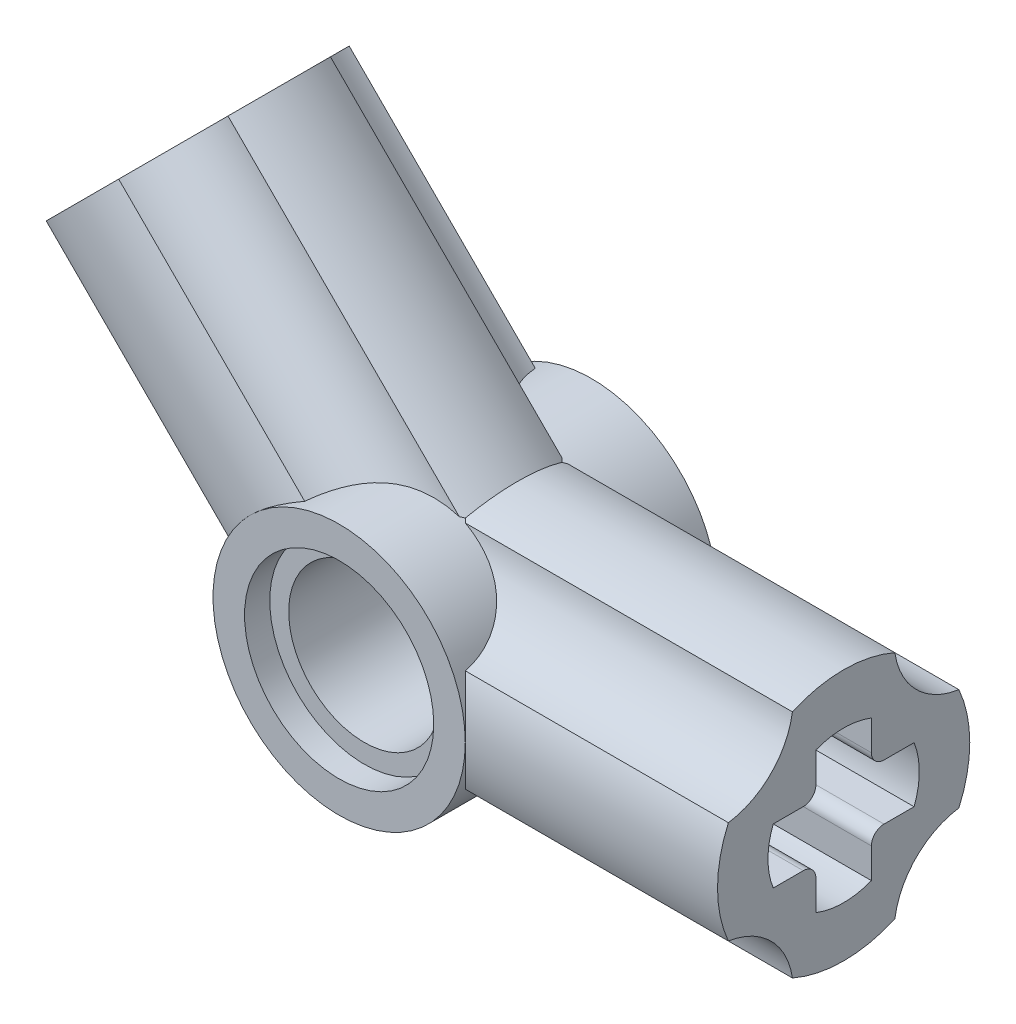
ISO-10303-21;
HEADER;
FILE_DESCRIPTION(('STEP AP214'),'2;1');
FILE_NAME('part.step','',(''),(''),'','','');
FILE_SCHEMA(('AUTOMOTIVE_DESIGN { 1 0 10303 214 1 1 1 1 }'));
ENDSEC;
DATA;
#1=APPLICATION_CONTEXT('core data for automotive mechanical design processes');
#2=APPLICATION_PROTOCOL_DEFINITION('international standard','automotive_design',2000,#1);
#3=PRODUCT_CONTEXT('',#1,'mechanical');
#4=PRODUCT('Part','Part','',(#3));
#5=PRODUCT_RELATED_PRODUCT_CATEGORY('part','',(#4));
#6=PRODUCT_DEFINITION_FORMATION('','',#4);
#7=PRODUCT_DEFINITION_CONTEXT('part definition',#1,'design');
#8=PRODUCT_DEFINITION('design','',#6,#7);
#9=PRODUCT_DEFINITION_SHAPE('','',#8);
#10=(LENGTH_UNIT() NAMED_UNIT(*) SI_UNIT(.MILLI.,.METRE.));
#11=(NAMED_UNIT(*) PLANE_ANGLE_UNIT() SI_UNIT($,.RADIAN.));
#12=(NAMED_UNIT(*) SI_UNIT($,.STERADIAN.) SOLID_ANGLE_UNIT());
#13=UNCERTAINTY_MEASURE_WITH_UNIT(LENGTH_MEASURE(1.E-05),#10,'distance_accuracy_value','');
#14=(GEOMETRIC_REPRESENTATION_CONTEXT(3) GLOBAL_UNCERTAINTY_ASSIGNED_CONTEXT((#13)) GLOBAL_UNIT_ASSIGNED_CONTEXT((#10,
#11,#12)) REPRESENTATION_CONTEXT('',''));
#15=CARTESIAN_POINT('',(0.,0.,0.));
#16=DIRECTION('',(0.,0.,1.));
#17=DIRECTION('',(1.,0.,0.));
#18=AXIS2_PLACEMENT_3D('',#15,#16,#17);
#19=CARTESIAN_POINT('',(-12.,0.,-4.));
#20=DIRECTION('',(0.,0.,1.));
#21=DIRECTION('',(1.,0.,0.));
#22=AXIS2_PLACEMENT_3D('',#19,#20,#21);
#23=CYLINDRICAL_SURFACE('',#22,4.);
#24=CARTESIAN_POINT('',(-12.0000000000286,5.6843418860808E-11,0.));
#25=DIRECTION('',(-0.500000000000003,0.499999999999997,0.707106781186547));
#26=DIRECTION('',(-0.500000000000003,0.499999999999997,-0.707106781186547));
#27=AXIS2_PLACEMENT_3D('',#24,#25,#26);
#28=ELLIPSE('',#27,5.65685424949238,4.);
#29=CARTESIAN_POINT('',(-10.5644513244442,3.73352380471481,-1.62491379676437));
#30=VERTEX_POINT('',#29);
#31=CARTESIAN_POINT('',(-10.4692662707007,3.6955181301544,-1.53073372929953));
#32=VERTEX_POINT('',#31);
#33=EDGE_CURVE('P0_E477',#30,#32,#28,.F.);
#34=ORIENTED_EDGE('',*,*,#33,.T.);
#35=CARTESIAN_POINT('',(-12.0000000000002,0.,0.));
#36=DIRECTION('',(0.707106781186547,0.,0.707106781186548));
#37=DIRECTION('',(0.707106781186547,0.,-0.707106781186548));
#38=AXIS2_PLACEMENT_3D('',#35,#36,#37);
#39=ELLIPSE('',#38,5.65685424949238,4.);
#40=CARTESIAN_POINT('',(-10.3750862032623,3.65508620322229,-1.62491379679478));
#41=VERTEX_POINT('',#40);
#42=EDGE_CURVE('P0_E586',#32,#41,#39,.F.);
#43=ORIENTED_EDGE('',*,*,#42,.T.);
#44=CARTESIAN_POINT('',(-10.3750862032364,3.65508620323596,-1.62491379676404));
#45=CARTESIAN_POINT('',(-10.2823139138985,3.61387188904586,-1.63092923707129));
#46=CARTESIAN_POINT('',(-10.1911709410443,3.56909577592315,-1.6384992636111));
#47=CARTESIAN_POINT('',(-10.0126857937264,3.47287100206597,-1.65807936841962));
#48=CARTESIAN_POINT('',(-9.92535378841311,3.42140579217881,-1.67010060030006));
#49=CARTESIAN_POINT('',(-9.75492013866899,3.31209012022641,-1.7000001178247));
#50=CARTESIAN_POINT('',(-9.67185200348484,3.25419788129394,-1.7179184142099));
#51=CARTESIAN_POINT('',(-9.51161777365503,3.13337103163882,-1.76101246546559));
#52=CARTESIAN_POINT('',(-9.43444436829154,3.07044287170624,-1.78617903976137));
#53=CARTESIAN_POINT('',(-9.26343126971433,2.92025141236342,-1.85455544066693));
#54=CARTESIAN_POINT('',(-9.17204364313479,2.83158792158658,-1.90095472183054));
#55=CARTESIAN_POINT('',(-9.00335038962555,2.65238561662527,-2.01130610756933));
#56=CARTESIAN_POINT('',(-8.92598770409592,2.56185614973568,-2.07518430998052));
#57=CARTESIAN_POINT('',(-8.82101407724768,2.42844107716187,-2.1851770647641));
#58=CARTESIAN_POINT('',(-8.78775386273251,2.38418821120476,-2.22439555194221));
#59=CARTESIAN_POINT('',(-8.72509637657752,2.29735939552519,-2.30748194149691));
#60=CARTESIAN_POINT('',(-8.6956974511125,2.25478273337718,-2.35134783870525));
#61=CARTESIAN_POINT('',(-8.64070585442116,2.17200832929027,-2.44362830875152));
#62=CARTESIAN_POINT('',(-8.61511868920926,2.13181407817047,-2.49204929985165));
#63=CARTESIAN_POINT('',(-8.5677048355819,2.05460502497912,-2.59305777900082));
#64=CARTESIAN_POINT('',(-8.54587776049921,2.01758989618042,-2.64564483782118));
#65=CARTESIAN_POINT('',(-8.48962965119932,1.91902233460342,-2.79865941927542));
#66=CARTESIAN_POINT('',(-8.45926306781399,1.86177889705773,-2.90344215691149));
#67=CARTESIAN_POINT('',(-8.40905565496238,1.763013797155,-3.12233368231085));
#68=CARTESIAN_POINT('',(-8.38920111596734,1.72147167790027,-3.23643009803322));
#69=CARTESIAN_POINT('',(-8.3675178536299,1.67490117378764,-3.40287021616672));
#70=CARTESIAN_POINT('',(-8.36190160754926,1.6626424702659,-3.45281321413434));
#71=CARTESIAN_POINT('',(-8.35224853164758,1.64135387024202,-3.55343145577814));
#72=CARTESIAN_POINT('',(-8.34820866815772,1.6323177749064,-3.6041050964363));
#73=CARTESIAN_POINT('',(-8.34491379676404,1.62491379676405,-3.6550862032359));
#74=B_SPLINE_CURVE_WITH_KNOTS('',3,(#44,#45,#46,#47,#48,#49,#50,#51,#52,#53,#54,#55,#56,#57,#58,
#59,#60,#61,#62,#63,#64,#65,#66,#67,#68,#69,#70,#71,#72,#73),.UNSPECIFIED.,.F.,.F.,(4,2,2,2,2,2,
2,2,2,2,2,2,2,2,4),(0.,0.305068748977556,0.61090715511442,0.918864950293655,1.22643439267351,
1.63131432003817,2.0345081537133,2.23779057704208,2.44098564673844,2.64447143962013,
2.84793629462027,3.21562348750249,3.58282996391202,3.73791688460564,3.89270385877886),.UNSPECIFIED.);
#75=CARTESIAN_POINT('',(-8.34491379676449,1.62491379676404,-3.65508620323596));
#76=VERTEX_POINT('',#75);
#77=EDGE_CURVE('P0_E813',#41,#76,#74,.T.);
#78=ORIENTED_EDGE('',*,*,#77,.T.);
#79=CARTESIAN_POINT('',(-12.0000000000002,0.,0.));
#80=DIRECTION('',(0.707106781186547,0.,0.707106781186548));
#81=DIRECTION('',(0.707106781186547,0.,-0.707106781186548));
#82=AXIS2_PLACEMENT_3D('',#79,#80,#81);
#83=ELLIPSE('',#82,5.65685424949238,4.);
#84=CARTESIAN_POINT('',(-8.,0.,-4.));
#85=VERTEX_POINT('',#84);
#86=EDGE_CURVE('P0_E569',#76,#85,#83,.F.);
#87=ORIENTED_EDGE('',*,*,#86,.T.);
#88=CARTESIAN_POINT('',(-12.,0.,-4.));
#89=DIRECTION('',(0.,0.,1.));
#90=DIRECTION('',(1.,0.,0.));
#91=AXIS2_PLACEMENT_3D('',#88,#89,#90);
#92=CIRCLE('',#91,4.);
#93=CARTESIAN_POINT('',(-14.8284271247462,2.82842712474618,-4.));
#94=VERTEX_POINT('',#93);
#95=EDGE_CURVE('P0_E564',#85,#94,#92,.T.);
#96=ORIENTED_EDGE('',*,*,#95,.T.);
#97=CARTESIAN_POINT('',(-12.0000000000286,5.6843418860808E-11,0.));
#98=DIRECTION('',(-0.500000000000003,0.499999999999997,0.707106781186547));
#99=DIRECTION('',(-0.500000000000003,0.499999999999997,-0.707106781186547));
#100=AXIS2_PLACEMENT_3D('',#97,#98,#99);
#101=ELLIPSE('',#100,5.65685424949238,4.);
#102=CARTESIAN_POINT('',(-13.4355486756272,3.73352380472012,-3.65508620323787));
#103=VERTEX_POINT('',#102);
#104=EDGE_CURVE('P0_E510',#94,#103,#101,.F.);
#105=ORIENTED_EDGE('',*,*,#104,.T.);
#106=CARTESIAN_POINT('',(-13.4355486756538,3.73352380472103,-3.65508620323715));
#107=CARTESIAN_POINT('',(-13.4266178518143,3.73694785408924,-3.5948657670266));
#108=CARTESIAN_POINT('',(-13.415326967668,3.74126209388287,-3.53504696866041));
#109=CARTESIAN_POINT('',(-13.38804976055,3.75147298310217,-3.41662458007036));
#110=CARTESIAN_POINT('',(-13.3720632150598,3.75736970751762,-3.35802104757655));
#111=CARTESIAN_POINT('',(-13.3354320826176,3.77054296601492,-3.24248433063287));
#112=CARTESIAN_POINT('',(-13.3147905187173,3.77781860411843,-3.18555008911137));
#113=CARTESIAN_POINT('',(-13.2689173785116,3.79347279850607,-3.07373991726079));
#114=CARTESIAN_POINT('',(-13.2436860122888,3.80185130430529,-3.01886389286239));
#115=CARTESIAN_POINT('',(-13.1611426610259,3.82819752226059,-2.85777764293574));
#116=CARTESIAN_POINT('',(-13.096995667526,3.84737038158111,-2.75515449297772));
#117=CARTESIAN_POINT('',(-12.9520083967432,3.88577790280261,-2.56268164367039));
#118=CARTESIAN_POINT('',(-12.8711794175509,3.90501251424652,-2.47282336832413));
#119=CARTESIAN_POINT('',(-12.6960894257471,3.93996484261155,-2.3085816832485));
#120=CARTESIAN_POINT('',(-12.6019776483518,3.9557172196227,-2.23404633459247));
#121=CARTESIAN_POINT('',(-12.4029189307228,3.98091826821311,-2.10000614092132));
#122=CARTESIAN_POINT('',(-12.2979727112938,3.99036735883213,-2.04050029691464));
#123=CARTESIAN_POINT('',(-12.0756485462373,4.00090497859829,-1.93338471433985));
#124=CARTESIAN_POINT('',(-11.9579166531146,4.00157421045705,-1.8864759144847));
#125=CARTESIAN_POINT('',(-11.7180697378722,3.99186155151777,-1.80641185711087));
#126=CARTESIAN_POINT('',(-11.5959449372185,3.98145331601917,-1.77328964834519));
#127=CARTESIAN_POINT('',(-11.3966847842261,3.95500083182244,-1.72863096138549));
#128=CARTESIAN_POINT('',(-11.3197935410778,3.94251679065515,-1.71365358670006));
#129=CARTESIAN_POINT('',(-11.166222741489,3.91291784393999,-1.68744785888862));
#130=CARTESIAN_POINT('',(-11.0895432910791,3.89580093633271,-1.67622113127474));
#131=CARTESIAN_POINT('',(-10.9373643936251,3.85706349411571,-1.65692530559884));
#132=CARTESIAN_POINT('',(-10.8618609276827,3.83546631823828,-1.64884043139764));
#133=CARTESIAN_POINT('',(-10.7121223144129,3.78781661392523,-1.63516177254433));
#134=CARTESIAN_POINT('',(-10.6378860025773,3.76176844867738,-1.62956556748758));
#135=CARTESIAN_POINT('',(-10.5644513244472,3.73352380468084,-1.62491379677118));
#136=B_SPLINE_CURVE_WITH_KNOTS('',3,(#106,#107,#108,#109,#110,#111,#112,#113,#114,#115,#116,
#117,#118,#119,#120,#121,#122,#123,#124,#125,#126,#127,#128,#129,#130,#131,#132,#133,#134,#135),
.UNSPECIFIED.,.F.,.F.,(4,2,2,2,2,2,2,2,2,2,2,2,2,2,4),(0.,0.182870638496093,0.365749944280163,
0.548510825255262,0.731263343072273,1.09690984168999,1.46230950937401,1.82388969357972,
2.18544583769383,2.56420913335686,2.94387523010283,3.18164590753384,3.41951950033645,
3.65618273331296,3.89261528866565),.UNSPECIFIED.);
#137=EDGE_CURVE('P0_E69',#103,#30,#136,.T.);
#138=ORIENTED_EDGE('',*,*,#137,.T.);
#139=EDGE_LOOP('',(#34,#43,#78,#87,#96,#105,#138));
#140=FACE_BOUND('',#139,.T.);
#141=ADVANCED_FACE('P0_F41',(#140),#23,.T.);
#142=CARTESIAN_POINT('',(-12.0000000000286,5.6843418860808E-11,0.));
#143=DIRECTION('',(-0.500000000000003,0.499999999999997,-0.707106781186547));
#144=DIRECTION('',(-0.500000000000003,0.499999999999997,0.707106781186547));
#145=AXIS2_PLACEMENT_3D('',#142,#143,#144);
#146=ELLIPSE('',#145,5.65685424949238,4.);
#147=CARTESIAN_POINT('',(-10.469266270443,3.69551813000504,1.53073372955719));
#148=VERTEX_POINT('',#147);
#149=CARTESIAN_POINT('',(-10.5644513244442,3.73352380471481,1.62491379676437));
#150=VERTEX_POINT('',#149);
#151=EDGE_CURVE('P0_E576',#148,#150,#146,.F.);
#152=ORIENTED_EDGE('',*,*,#151,.T.);
#153=CARTESIAN_POINT('',(-10.5644513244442,3.73352380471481,1.62491379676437));
#154=CARTESIAN_POINT('',(-10.6591941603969,3.76998079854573,1.6309292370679));
#155=CARTESIAN_POINT('',(-10.7553034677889,3.80276711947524,1.63849926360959));
#156=CARTESIAN_POINT('',(-10.9495527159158,3.86093398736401,1.6580793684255));
#157=CARTESIAN_POINT('',(-11.0476971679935,3.88629564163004,1.67010060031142));
#158=CARTESIAN_POINT('',(-11.2455098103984,3.92951257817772,1.70000011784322));
#159=CARTESIAN_POINT('',(-11.3451838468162,3.94731462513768,1.71791841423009));
#160=CARTESIAN_POINT('',(-11.5439240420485,3.97517985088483,1.76101246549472));
#161=CARTESIAN_POINT('',(-11.6429908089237,3.98525276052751,1.78617903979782));
#162=CARTESIAN_POINT('',(-11.8701167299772,3.9999758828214,1.85455544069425));
#163=CARTESIAN_POINT('',(-11.9974320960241,4.00190213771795,1.90095472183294));
#164=CARTESIAN_POINT('',(-12.243431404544,3.99447111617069,2.01130610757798));
#165=CARTESIAN_POINT('',(-12.3621490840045,3.98516079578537,2.07518431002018));
#166=CARTESIAN_POINT('',(-12.5307153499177,3.9650496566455,2.18517706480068));
#167=CARTESIAN_POINT('',(-12.585525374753,3.9572766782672,2.22439555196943));
#168=CARTESIAN_POINT('',(-12.6912281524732,3.94018496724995,2.30748194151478));
#169=CARTESIAN_POINT('',(-12.74212257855,3.93086690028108,2.35134783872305));
#170=CARTESIAN_POINT('',(-12.839537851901,3.91122148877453,2.44362830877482));
#171=CARTESIAN_POINT('',(-12.8860523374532,3.90089271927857,2.49204929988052));
#172=CARTESIAN_POINT('',(-12.9741740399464,3.87982433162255,2.59305777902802));
#173=CARTESIAN_POINT('',(-13.0157817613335,3.86908475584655,2.64564483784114));
#174=CARTESIAN_POINT('',(-13.1252529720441,3.83916038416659,2.79865941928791));
#175=CARTESIAN_POINT('',(-13.1872026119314,3.82015557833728,2.90344215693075));
#176=CARTESIAN_POINT('',(-13.2925420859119,3.78582010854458,3.12233368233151));
#177=CARTESIAN_POINT('',(-13.3359560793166,3.77048467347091,3.23643009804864));
#178=CARTESIAN_POINT('',(-13.3842187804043,3.75288673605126,3.40287021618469));
#179=CARTESIAN_POINT('',(-13.3968582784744,3.74818980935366,3.45281321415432));
#180=CARTESIAN_POINT('',(-13.4187373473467,3.73996225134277,3.55343145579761));
#181=CARTESIAN_POINT('',(-13.4279834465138,3.73642938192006,3.60410509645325));
#182=CARTESIAN_POINT('',(-13.4355486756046,3.73352380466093,3.65508620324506));
#183=B_SPLINE_CURVE_WITH_KNOTS('',3,(#153,#154,#155,#156,#157,#158,#159,#160,#161,#162,#163,
#164,#165,#166,#167,#168,#169,#170,#171,#172,#173,#174,#175,#176,#177,#178,#179,#180,#181,#182),
.UNSPECIFIED.,.F.,.F.,(4,2,2,2,2,2,2,2,2,2,2,2,2,2,4),(0.,0.305068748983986,0.610907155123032,
0.918864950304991,1.22643439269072,1.63131432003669,2.03450815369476,2.23779057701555,
2.4409856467,2.64447143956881,2.84793629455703,3.21562348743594,3.58282996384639,
3.73791688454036,3.8927038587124),.UNSPECIFIED.);
#184=CARTESIAN_POINT('',(-13.4355486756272,3.73352380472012,3.65508620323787));
#185=VERTEX_POINT('',#184);
#186=EDGE_CURVE('P0_E470',#150,#185,#183,.T.);
#187=ORIENTED_EDGE('',*,*,#186,.T.);
#188=CARTESIAN_POINT('',(-12.0000000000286,5.6843418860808E-11,0.));
#189=DIRECTION('',(-0.500000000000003,0.499999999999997,-0.707106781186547));
#190=DIRECTION('',(-0.500000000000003,0.499999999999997,0.707106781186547));
#191=AXIS2_PLACEMENT_3D('',#188,#189,#190);
#192=ELLIPSE('',#191,5.65685424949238,4.);
#193=CARTESIAN_POINT('',(-14.8284271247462,2.82842712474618,4.));
#194=VERTEX_POINT('',#193);
#195=EDGE_CURVE('P0_E601',#185,#194,#192,.F.);
#196=ORIENTED_EDGE('',*,*,#195,.T.);
#197=CARTESIAN_POINT('',(-12.,0.,4.));
#198=DIRECTION('',(0.,0.,1.));
#199=DIRECTION('',(1.,0.,0.));
#200=AXIS2_PLACEMENT_3D('',#197,#198,#199);
#201=CIRCLE('',#200,4.);
#202=CARTESIAN_POINT('',(-8.,0.,4.));
#203=VERTEX_POINT('',#202);
#204=EDGE_CURVE('P0_E566',#203,#194,#201,.T.);
#205=ORIENTED_EDGE('',*,*,#204,.F.);
#206=CARTESIAN_POINT('',(-12.0000000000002,0.,0.));
#207=DIRECTION('',(0.707106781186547,0.,-0.707106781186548));
#208=DIRECTION('',(0.707106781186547,0.,0.707106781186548));
#209=AXIS2_PLACEMENT_3D('',#206,#207,#208);
#210=ELLIPSE('',#209,5.65685424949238,4.);
#211=CARTESIAN_POINT('',(-8.34491379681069,1.62491379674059,3.65508620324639));
#212=VERTEX_POINT('',#211);
#213=EDGE_CURVE('P0_E855',#203,#212,#210,.F.);
#214=ORIENTED_EDGE('',*,*,#213,.T.);
#215=CARTESIAN_POINT('',(-8.34491379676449,1.62491379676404,3.65508620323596));
#216=CARTESIAN_POINT('',(-8.34880767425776,1.63365001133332,3.59486576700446));
#217=CARTESIAN_POINT('',(-8.35374090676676,1.64468450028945,3.5350469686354));
#218=CARTESIAN_POINT('',(-8.3658086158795,1.67119258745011,3.41662458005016));
#219=CARTESIAN_POINT('',(-8.37294319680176,1.68666639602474,3.35802104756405));
#220=CARTESIAN_POINT('',(-8.38953041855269,1.72188341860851,3.2424843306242));
#221=CARTESIAN_POINT('',(-8.39898155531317,1.74162386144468,3.18555008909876));
#222=CARTESIAN_POINT('',(-8.42034957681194,1.78513025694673,3.07373991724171));
#223=CARTESIAN_POINT('',(-8.43226634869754,1.80889602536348,3.01886389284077));
#224=CARTESIAN_POINT('',(-8.47200372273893,1.88589257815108,2.85777764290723));
#225=CARTESIAN_POINT('',(-8.50380523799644,1.94480861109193,2.75515449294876));
#226=CARTESIAN_POINT('',(-8.57916850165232,2.07448831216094,2.56268164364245));
#227=CARTESIAN_POINT('',(-8.62272229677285,2.1452439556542,2.47282336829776));
#228=CARTESIAN_POINT('',(-8.72181458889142,2.29376630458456,2.3085816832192));
#229=CARTESIAN_POINT('',(-8.77722305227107,2.37145199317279,2.23404633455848));
#230=CARTESIAN_POINT('',(-8.90015898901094,2.53002759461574,2.10000614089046));
#231=CARTESIAN_POINT('',(-8.96768565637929,2.61091729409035,2.04050029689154));
#232=CARTESIAN_POINT('',(-9.11744135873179,2.77557544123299,1.93338471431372));
#233=CARTESIAN_POINT('',(-9.20021716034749,2.8592976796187,1.88647591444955));
#234=CARTESIAN_POINT('',(-9.37668242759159,3.02202717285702,1.80641185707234));
#235=CARTESIAN_POINT('',(-9.47039743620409,3.10102271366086,1.77328964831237));
#236=CARTESIAN_POINT('',(-9.63000037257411,3.22321618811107,1.72863096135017));
#237=CARTESIAN_POINT('',(-9.69319824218,3.26875895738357,1.71365358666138));
#238=CARTESIAN_POINT('',(-9.82271881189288,3.35642029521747,1.6874478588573));
#239=CARTESIAN_POINT('',(-9.88904285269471,3.39853737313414,1.67622113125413));
#240=CARTESIAN_POINT('',(-10.024041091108,3.47875259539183,1.65692530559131));
#241=CARTESIAN_POINT('',(-10.0927016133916,3.51687009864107,1.6488404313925));
#242=CARTESIAN_POINT('',(-10.2322762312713,3.58905785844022,1.63516177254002));
#243=CARTESIAN_POINT('',(-10.3031880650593,3.62313202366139,1.62956556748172));
#244=CARTESIAN_POINT('',(-10.3750862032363,3.65508620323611,1.62491379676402));
#245=B_SPLINE_CURVE_WITH_KNOTS('',3,(#215,#216,#217,#218,#219,#220,#221,#222,#223,#224,#225,
#226,#227,#228,#229,#230,#231,#232,#233,#234,#235,#236,#237,#238,#239,#240,#241,#242,#243,#244),
.UNSPECIFIED.,.F.,.F.,(4,2,2,2,2,2,2,2,2,2,2,2,2,2,4),(0.,0.182870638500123,0.365749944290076,
0.548510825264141,0.731263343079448,1.09690984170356,1.46230950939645,1.82388969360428,
2.18544583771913,2.56420913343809,2.94387523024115,3.18164590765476,3.41951950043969,
3.65618273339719,3.89261528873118),.UNSPECIFIED.);
#246=CARTESIAN_POINT('',(-10.3750862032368,3.65508620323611,1.62491379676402));
#247=VERTEX_POINT('',#246);
#248=EDGE_CURVE('P0_E856',#212,#247,#245,.T.);
#249=ORIENTED_EDGE('',*,*,#248,.T.);
#250=CARTESIAN_POINT('',(-12.0000000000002,0.,0.));
#251=DIRECTION('',(0.707106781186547,0.,-0.707106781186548));
#252=DIRECTION('',(0.707106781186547,0.,0.707106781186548));
#253=AXIS2_PLACEMENT_3D('',#250,#251,#252);
#254=ELLIPSE('',#253,5.65685424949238,4.);
#255=EDGE_CURVE('P0_E595',#247,#148,#254,.F.);
#256=ORIENTED_EDGE('',*,*,#255,.T.);
#257=EDGE_LOOP('',(#152,#187,#196,#205,#214,#249,#256));
#258=FACE_BOUND('',#257,.T.);
#259=ADVANCED_FACE('P0_F535',(#258),#23,.T.);
#260=CARTESIAN_POINT('',(-15.7335238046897,1.43554867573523,-3.65508620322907));
#261=VERTEX_POINT('',#260);
#262=EDGE_CURVE('P0_E512',#261,#94,#101,.F.);
#263=ORIENTED_EDGE('',*,*,#262,.T.);
#264=EDGE_CURVE('P0_E555',#94,#85,#92,.T.);
#265=ORIENTED_EDGE('',*,*,#264,.T.);
#266=CARTESIAN_POINT('',(-8.34491379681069,-1.62491379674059,-3.65508620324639));
#267=VERTEX_POINT('',#266);
#268=EDGE_CURVE('P0_E836',#85,#267,#83,.F.);
#269=ORIENTED_EDGE('',*,*,#268,.T.);
#270=CARTESIAN_POINT('',(-8.3449137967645,-1.62491379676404,-3.65508620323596));
#271=CARTESIAN_POINT('',(-8.34880767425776,-1.63365001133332,-3.59486576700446));
#272=CARTESIAN_POINT('',(-8.35374090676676,-1.64468450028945,-3.5350469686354));
#273=CARTESIAN_POINT('',(-8.3658086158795,-1.67119258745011,-3.41662458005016));
#274=CARTESIAN_POINT('',(-8.37294319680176,-1.68666639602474,-3.35802104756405));
#275=CARTESIAN_POINT('',(-8.38953041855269,-1.72188341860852,-3.2424843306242));
#276=CARTESIAN_POINT('',(-8.39898155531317,-1.74162386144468,-3.18555008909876));
#277=CARTESIAN_POINT('',(-8.42034957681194,-1.78513025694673,-3.07373991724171));
#278=CARTESIAN_POINT('',(-8.43226634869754,-1.80889602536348,-3.01886389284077));
#279=CARTESIAN_POINT('',(-8.47200372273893,-1.88589257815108,-2.85777764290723));
#280=CARTESIAN_POINT('',(-8.50380523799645,-1.94480861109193,-2.75515449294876));
#281=CARTESIAN_POINT('',(-8.57916850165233,-2.07448831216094,-2.56268164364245));
#282=CARTESIAN_POINT('',(-8.62272229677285,-2.1452439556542,-2.47282336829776));
#283=CARTESIAN_POINT('',(-8.72181458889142,-2.29376630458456,-2.3085816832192));
#284=CARTESIAN_POINT('',(-8.77722305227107,-2.37145199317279,-2.23404633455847));
#285=CARTESIAN_POINT('',(-8.90015898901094,-2.53002759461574,-2.10000614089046));
#286=CARTESIAN_POINT('',(-8.96768565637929,-2.61091729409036,-2.04050029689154));
#287=CARTESIAN_POINT('',(-9.11744135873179,-2.77557544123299,-1.93338471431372));
#288=CARTESIAN_POINT('',(-9.2002171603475,-2.85929767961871,-1.88647591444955));
#289=CARTESIAN_POINT('',(-9.37668242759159,-3.02202717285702,-1.80641185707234));
#290=CARTESIAN_POINT('',(-9.4703974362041,-3.10102271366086,-1.77328964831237));
#291=CARTESIAN_POINT('',(-9.63000037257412,-3.22321618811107,-1.72863096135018));
#292=CARTESIAN_POINT('',(-9.69319824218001,-3.26875895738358,-1.71365358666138));
#293=CARTESIAN_POINT('',(-9.82271881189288,-3.35642029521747,-1.6874478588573));
#294=CARTESIAN_POINT('',(-9.88904285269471,-3.39853737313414,-1.67622113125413));
#295=CARTESIAN_POINT('',(-10.024041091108,-3.47875259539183,-1.65692530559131));
#296=CARTESIAN_POINT('',(-10.0927016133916,-3.51687009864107,-1.6488404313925));
#297=CARTESIAN_POINT('',(-10.2322762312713,-3.58905785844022,-1.63516177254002));
#298=CARTESIAN_POINT('',(-10.3031880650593,-3.62313202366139,-1.62956556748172));
#299=CARTESIAN_POINT('',(-10.3750862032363,-3.65508620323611,-1.62491379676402));
#300=B_SPLINE_CURVE_WITH_KNOTS('',3,(#270,#271,#272,#273,#274,#275,#276,#277,#278,#279,#280,
#281,#282,#283,#284,#285,#286,#287,#288,#289,#290,#291,#292,#293,#294,#295,#296,#297,#298,#299),
.UNSPECIFIED.,.F.,.F.,(4,2,2,2,2,2,2,2,2,2,2,2,2,2,4),(0.,0.182870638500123,0.365749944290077,
0.548510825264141,0.731263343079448,1.09690984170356,1.46230950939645,1.82388969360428,
2.18544583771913,2.56420913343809,2.94387523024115,3.18164590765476,3.41951950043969,
3.65618273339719,3.89261528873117),.UNSPECIFIED.);
#301=CARTESIAN_POINT('',(-10.3750862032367,-3.65508620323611,-1.62491379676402));
#302=VERTEX_POINT('',#301);
#303=EDGE_CURVE('P0_E1494',#267,#302,#300,.T.);
#304=ORIENTED_EDGE('',*,*,#303,.T.);
#305=CARTESIAN_POINT('',(-12.0000000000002,0.,0.));
#306=DIRECTION('',(0.707106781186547,0.,0.707106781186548));
#307=DIRECTION('',(0.707106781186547,0.,-0.707106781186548));
#308=AXIS2_PLACEMENT_3D('',#305,#306,#307);
#309=ELLIPSE('',#308,5.65685424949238,4.);
#310=CARTESIAN_POINT('',(-12.0000000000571,-4.,0.));
#311=VERTEX_POINT('',#310);
#312=EDGE_CURVE('P0_E809',#302,#311,#309,.F.);
#313=ORIENTED_EDGE('',*,*,#312,.T.);
#314=CARTESIAN_POINT('',(-12.0000000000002,0.,0.));
#315=DIRECTION('',(0.707106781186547,0.,-0.707106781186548));
#316=DIRECTION('',(0.707106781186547,0.,0.707106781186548));
#317=AXIS2_PLACEMENT_3D('',#314,#315,#316);
#318=ELLIPSE('',#317,5.65685424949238,4.);
#319=CARTESIAN_POINT('',(-10.3750862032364,-3.65508620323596,1.62491379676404));
#320=VERTEX_POINT('',#319);
#321=EDGE_CURVE('P0_E1499',#311,#320,#318,.F.);
#322=ORIENTED_EDGE('',*,*,#321,.T.);
#323=CARTESIAN_POINT('',(-10.3750862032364,-3.65508620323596,1.62491379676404));
#324=CARTESIAN_POINT('',(-10.2823139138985,-3.61387188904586,1.63092923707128));
#325=CARTESIAN_POINT('',(-10.1911709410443,-3.56909577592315,1.6384992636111));
#326=CARTESIAN_POINT('',(-10.0126857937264,-3.47287100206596,1.65807936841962));
#327=CARTESIAN_POINT('',(-9.9253537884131,-3.42140579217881,1.67010060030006));
#328=CARTESIAN_POINT('',(-9.75492013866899,-3.3120901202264,1.7000001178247));
#329=CARTESIAN_POINT('',(-9.67185200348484,-3.25419788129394,1.71791841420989));
#330=CARTESIAN_POINT('',(-9.51161777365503,-3.13337103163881,1.76101246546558));
#331=CARTESIAN_POINT('',(-9.43444436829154,-3.07044287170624,1.78617903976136));
#332=CARTESIAN_POINT('',(-9.26343126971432,-2.92025141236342,1.85455544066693));
#333=CARTESIAN_POINT('',(-9.17204364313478,-2.83158792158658,1.90095472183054));
#334=CARTESIAN_POINT('',(-9.00335038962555,-2.65238561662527,2.01130610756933));
#335=CARTESIAN_POINT('',(-8.92598770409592,-2.56185614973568,2.07518430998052));
#336=CARTESIAN_POINT('',(-8.82101407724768,-2.42844107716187,2.1851770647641));
#337=CARTESIAN_POINT('',(-8.7877538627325,-2.38418821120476,2.22439555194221));
#338=CARTESIAN_POINT('',(-8.72509637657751,-2.29735939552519,2.30748194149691));
#339=CARTESIAN_POINT('',(-8.69569745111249,-2.25478273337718,2.35134783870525));
#340=CARTESIAN_POINT('',(-8.64070585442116,-2.17200832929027,2.44362830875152));
#341=CARTESIAN_POINT('',(-8.61511868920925,-2.13181407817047,2.49204929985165));
#342=CARTESIAN_POINT('',(-8.5677048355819,-2.05460502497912,2.59305777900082));
#343=CARTESIAN_POINT('',(-8.54587776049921,-2.01758989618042,2.64564483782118));
#344=CARTESIAN_POINT('',(-8.48962965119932,-1.91902233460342,2.79865941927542));
#345=CARTESIAN_POINT('',(-8.45926306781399,-1.86177889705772,2.90344215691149));
#346=CARTESIAN_POINT('',(-8.40905565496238,-1.763013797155,3.12233368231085));
#347=CARTESIAN_POINT('',(-8.38920111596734,-1.72147167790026,3.23643009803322));
#348=CARTESIAN_POINT('',(-8.3675178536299,-1.67490117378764,3.40287021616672));
#349=CARTESIAN_POINT('',(-8.36190160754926,-1.66264247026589,3.45281321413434));
#350=CARTESIAN_POINT('',(-8.35224853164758,-1.64135387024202,3.55343145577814));
#351=CARTESIAN_POINT('',(-8.34820866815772,-1.6323177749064,3.6041050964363));
#352=CARTESIAN_POINT('',(-8.34491379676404,-1.62491379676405,3.65508620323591));
#353=B_SPLINE_CURVE_WITH_KNOTS('',3,(#323,#324,#325,#326,#327,#328,#329,#330,#331,#332,#333,
#334,#335,#336,#337,#338,#339,#340,#341,#342,#343,#344,#345,#346,#347,#348,#349,#350,#351,#352),
.UNSPECIFIED.,.F.,.F.,(4,2,2,2,2,2,2,2,2,2,2,2,2,2,4),(0.,0.305068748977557,0.610907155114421,
0.918864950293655,1.22643439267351,1.63131432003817,2.03450815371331,2.23779057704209,
2.44098564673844,2.64447143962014,2.84793629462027,3.21562348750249,3.58282996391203,
3.73791688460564,3.89270385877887),.UNSPECIFIED.);
#354=CARTESIAN_POINT('',(-8.34491379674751,-1.62491379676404,3.65508620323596));
#355=VERTEX_POINT('',#354);
#356=EDGE_CURVE('P0_E803',#320,#355,#353,.T.);
#357=ORIENTED_EDGE('',*,*,#356,.T.);
#358=EDGE_CURVE('P0_E852',#355,#203,#210,.F.);
#359=ORIENTED_EDGE('',*,*,#358,.T.);
#360=EDGE_CURVE('P0_E854',#194,#203,#201,.T.);
#361=ORIENTED_EDGE('',*,*,#360,.F.);
#362=CARTESIAN_POINT('',(-15.7335238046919,1.43554867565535,3.65508620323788));
#363=VERTEX_POINT('',#362);
#364=EDGE_CURVE('P0_E427',#194,#363,#192,.F.);
#365=ORIENTED_EDGE('',*,*,#364,.T.);
#366=CARTESIAN_POINT('',(-15.7335238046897,1.43554867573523,3.65508620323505));
#367=CARTESIAN_POINT('',(-15.7369478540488,1.42661785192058,3.59486576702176));
#368=CARTESIAN_POINT('',(-15.7412620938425,1.41532696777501,3.53504696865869));
#369=CARTESIAN_POINT('',(-15.7514729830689,1.3880497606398,3.41662458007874));
#370=CARTESIAN_POINT('',(-15.7573697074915,1.37206321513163,3.35802104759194));
#371=CARTESIAN_POINT('',(-15.7705429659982,1.33543208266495,3.24248433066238));
#372=CARTESIAN_POINT('',(-15.7778186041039,1.31479051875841,3.18555008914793));
#373=CARTESIAN_POINT('',(-15.7934727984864,1.26891737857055,3.07373991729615));
#374=CARTESIAN_POINT('',(-15.8018513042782,1.24368601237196,3.01886389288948));
#375=CARTESIAN_POINT('',(-15.8281975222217,1.16114266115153,2.85777764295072));
#376=CARTESIAN_POINT('',(-15.8473703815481,1.09699566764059,2.75515449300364));
#377=CARTESIAN_POINT('',(-15.8857779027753,0.952008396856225,2.56268164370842));
#378=CARTESIAN_POINT('',(-15.9050125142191,0.871179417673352,2.47282336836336));
#379=CARTESIAN_POINT('',(-15.9399648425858,0.696089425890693,2.30858168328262));
#380=CARTESIAN_POINT('',(-15.9557172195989,0.601977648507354,2.23404633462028));
#381=CARTESIAN_POINT('',(-15.9809182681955,0.402918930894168,2.10000614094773));
#382=CARTESIAN_POINT('',(-15.9903673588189,0.297972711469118,2.04050029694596));
#383=CARTESIAN_POINT('',(-16.0009049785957,0.0756485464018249,1.93338471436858));
#384=CARTESIAN_POINT('',(-16.0015742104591,-0.0420833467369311,1.88647591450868));
#385=CARTESIAN_POINT('',(-15.9918615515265,-0.28193026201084,1.80641185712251));
#386=CARTESIAN_POINT('',(-15.9814533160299,-0.404055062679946,1.77328964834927));
#387=CARTESIAN_POINT('',(-15.9550008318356,-0.603315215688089,1.72863096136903));
#388=CARTESIAN_POINT('',(-15.9425167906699,-0.680206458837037,1.71365358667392));
#389=CARTESIAN_POINT('',(-15.912917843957,-0.833777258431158,1.68744785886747));
#390=CARTESIAN_POINT('',(-15.8958009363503,-0.910456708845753,1.67622113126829));
#391=CARTESIAN_POINT('',(-15.8570634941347,-1.06263560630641,1.65692530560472));
#392=CARTESIAN_POINT('',(-15.8354663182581,-1.13813907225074,1.64884043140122));
#393=CARTESIAN_POINT('',(-15.7878166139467,-1.28787768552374,1.63516177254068));
#394=CARTESIAN_POINT('',(-15.7617684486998,-1.36211399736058,1.62956556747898));
#395=CARTESIAN_POINT('',(-15.7335238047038,-1.43554867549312,1.62491379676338));
#396=B_SPLINE_CURVE_WITH_KNOTS('',3,(#366,#367,#368,#369,#370,#371,#372,#373,#374,#375,#376,
#377,#378,#379,#380,#381,#382,#383,#384,#385,#386,#387,#388,#389,#390,#391,#392,#393,#394,#395),
.UNSPECIFIED.,.F.,.F.,(4,2,2,2,2,2,2,2,2,2,2,2,2,2,4),(0.,0.182870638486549,0.365749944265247,
0.548510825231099,0.731263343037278,1.09690984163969,1.46230950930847,1.82388969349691,
2.18544583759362,2.56420913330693,2.94387523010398,3.18164590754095,3.41951950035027,
3.65618273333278,3.89261528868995),.UNSPECIFIED.);
#397=CARTESIAN_POINT('',(-15.7335238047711,-1.43554867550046,1.62491379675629));
#398=VERTEX_POINT('',#397);
#399=EDGE_CURVE('P0_E493',#363,#398,#396,.T.);
#400=ORIENTED_EDGE('',*,*,#399,.T.);
#401=CARTESIAN_POINT('',(-12.0000000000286,5.6843418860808E-11,0.));
#402=DIRECTION('',(-0.500000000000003,0.499999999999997,-0.707106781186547));
#403=DIRECTION('',(-0.500000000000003,0.499999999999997,0.707106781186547));
#404=AXIS2_PLACEMENT_3D('',#401,#402,#403);
#405=ELLIPSE('',#404,5.65685424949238,4.);
#406=CARTESIAN_POINT('',(-14.8284271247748,-2.82842712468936,0.));
#407=VERTEX_POINT('',#406);
#408=EDGE_CURVE('P0_E1432',#398,#407,#405,.F.);
#409=ORIENTED_EDGE('',*,*,#408,.T.);
#410=CARTESIAN_POINT('',(-12.0000000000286,5.6843418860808E-11,0.));
#411=DIRECTION('',(-0.500000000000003,0.499999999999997,0.707106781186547));
#412=DIRECTION('',(-0.500000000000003,0.499999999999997,-0.707106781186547));
#413=AXIS2_PLACEMENT_3D('',#410,#411,#412);
#414=ELLIPSE('',#413,5.65685424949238,4.);
#415=CARTESIAN_POINT('',(-15.7335238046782,-1.43554867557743,-1.62491379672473));
#416=VERTEX_POINT('',#415);
#417=EDGE_CURVE('P0_E511',#407,#416,#414,.F.);
#418=ORIENTED_EDGE('',*,*,#417,.T.);
#419=CARTESIAN_POINT('',(-15.7335238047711,-1.43554867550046,-1.62491379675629));
#420=CARTESIAN_POINT('',(-15.7699807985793,-1.34080583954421,-1.630929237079));
#421=CARTESIAN_POINT('',(-15.8027671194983,-1.24469653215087,-1.63849926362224));
#422=CARTESIAN_POINT('',(-15.8609339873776,-1.05044728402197,-1.65807936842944));
#423=CARTESIAN_POINT('',(-15.8862956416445,-0.952302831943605,-1.67010060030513));
#424=CARTESIAN_POINT('',(-15.9295125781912,-0.754490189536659,-1.70000011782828));
#425=CARTESIAN_POINT('',(-15.9473146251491,-0.654816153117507,-1.71791841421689));
#426=CARTESIAN_POINT('',(-15.9751798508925,-0.456075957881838,-1.76101246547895));
#427=CARTESIAN_POINT('',(-15.9852527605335,-0.357009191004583,-1.78617903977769));
#428=CARTESIAN_POINT('',(-15.9999758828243,-0.129883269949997,-1.854555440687));
#429=CARTESIAN_POINT('',(-16.001902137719,-0.00256790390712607,-1.90095472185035));
#430=CARTESIAN_POINT('',(-15.994471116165,0.243431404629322,-2.01130610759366));
#431=CARTESIAN_POINT('',(-15.9851607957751,0.362149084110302,-2.07518431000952));
#432=CARTESIAN_POINT('',(-15.9650496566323,0.530715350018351,-2.18517706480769));
#433=CARTESIAN_POINT('',(-15.9572766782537,0.585525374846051,-2.22439555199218));
#434=CARTESIAN_POINT('',(-15.9401849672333,0.691228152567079,-2.30748194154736));
#435=CARTESIAN_POINT('',(-15.9308669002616,0.742122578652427,-2.35134783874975));
#436=CARTESIAN_POINT('',(-15.911221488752,0.839537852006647,-2.44362830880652));
#437=CARTESIAN_POINT('',(-15.9008927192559,0.886052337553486,-2.49204929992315));
#438=CARTESIAN_POINT('',(-15.8798243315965,0.974174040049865,-2.59305777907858));
#439=CARTESIAN_POINT('',(-15.8690847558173,1.01578176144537,-2.64564483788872));
#440=CARTESIAN_POINT('',(-15.8391603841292,1.12525297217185,-2.79865941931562));
#441=CARTESIAN_POINT('',(-15.8201555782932,1.18720261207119,-2.90344215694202));
#442=CARTESIAN_POINT('',(-15.7858201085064,1.29254208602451,-3.12233368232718));
#443=CARTESIAN_POINT('',(-15.7704846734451,1.33595607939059,-3.23643009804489));
#444=CARTESIAN_POINT('',(-15.7528867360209,1.38421878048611,-3.40287021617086));
#445=CARTESIAN_POINT('',(-15.7481898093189,1.39685827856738,-3.45281321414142));
#446=CARTESIAN_POINT('',(-15.7399622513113,1.41873734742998,-3.55343145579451));
#447=CARTESIAN_POINT('',(-15.7364293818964,1.42798344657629,-3.60410509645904));
#448=CARTESIAN_POINT('',(-15.7335238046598,1.4355486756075,-3.65508620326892));
#449=B_SPLINE_CURVE_WITH_KNOTS('',3,(#419,#420,#421,#422,#423,#424,#425,#426,#427,#428,#429,
#430,#431,#432,#433,#434,#435,#436,#437,#438,#439,#440,#441,#442,#443,#444,#445,#446,#447,#448),
.UNSPECIFIED.,.F.,.F.,(4,2,2,2,2,2,2,2,2,2,2,2,2,2,4),(0.,0.305068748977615,0.610907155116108,
0.918864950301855,1.22643439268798,1.63131432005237,2.0345081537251,2.23779057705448,
2.44098564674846,2.6444714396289,2.84793629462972,3.2156234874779,3.58282996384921,
3.73791688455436,3.89270385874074),.UNSPECIFIED.);
#450=EDGE_CURVE('P0_E503',#416,#261,#449,.T.);
#451=ORIENTED_EDGE('',*,*,#450,.T.);
#452=EDGE_LOOP('',(#263,#265,#269,#304,#313,#322,#357,#359,#361,#365,#400,#409,#418,#451));
#453=FACE_BOUND('',#452,.T.);
#454=ADVANCED_FACE('P0_F537',(#453),#23,.T.);
#455=CARTESIAN_POINT('',(-8.,0.,-4.));
#456=DIRECTION('',(0.,0.,-1.));
#457=DIRECTION('',(-1.,0.,0.));
#458=AXIS2_PLACEMENT_3D('',#455,#456,#457);
#459=PLANE('',#458);
#460=CARTESIAN_POINT('',(-12.,0.,-4.));
#461=DIRECTION('',(0.,0.,1.));
#462=DIRECTION('',(1.,0.,0.));
#463=AXIS2_PLACEMENT_3D('',#460,#461,#462);
#464=CIRCLE('',#463,3.);
#465=CARTESIAN_POINT('',(-9.,0.,-4.));
#466=VERTEX_POINT('',#465);
#467=EDGE_CURVE('P0_E622',#466,#466,#464,.T.);
#468=ORIENTED_EDGE('',*,*,#467,.T.);
#469=EDGE_LOOP('',(#468));
#470=FACE_BOUND('',#469,.T.);
#471=ORIENTED_EDGE('',*,*,#95,.F.);
#472=ORIENTED_EDGE('',*,*,#264,.F.);
#473=EDGE_LOOP('',(#471,#472));
#474=FACE_BOUND('',#473,.T.);
#475=ADVANCED_FACE('P0_F546',(#470,#474),#459,.T.);
#476=CARTESIAN_POINT('',(-12.,0.,4.));
#477=DIRECTION('',(0.,0.,1.));
#478=DIRECTION('',(1.,0.,0.));
#479=AXIS2_PLACEMENT_3D('',#476,#477,#478);
#480=PLANE('',#479);
#481=CARTESIAN_POINT('',(-12.,0.,4.));
#482=DIRECTION('',(0.,0.,1.));
#483=DIRECTION('',(1.,0.,0.));
#484=AXIS2_PLACEMENT_3D('',#481,#482,#483);
#485=CIRCLE('',#484,3.);
#486=CARTESIAN_POINT('',(-9.,0.,4.));
#487=VERTEX_POINT('',#486);
#488=EDGE_CURVE('P0_E619',#487,#487,#485,.T.);
#489=ORIENTED_EDGE('',*,*,#488,.F.);
#490=EDGE_LOOP('',(#489));
#491=FACE_BOUND('',#490,.T.);
#492=ORIENTED_EDGE('',*,*,#204,.T.);
#493=ORIENTED_EDGE('',*,*,#360,.T.);
#494=EDGE_LOOP('',(#492,#493));
#495=FACE_BOUND('',#494,.T.);
#496=ADVANCED_FACE('P0_F551',(#491,#495),#480,.T.);
#497=CARTESIAN_POINT('',(-500000.,0.,0.));
#498=DIRECTION('',(1.,0.,0.));
#499=DIRECTION('',(0.,0.,-1.));
#500=AXIS2_PLACEMENT_3D('',#497,#498,#499);
#501=CYLINDRICAL_SURFACE('',#500,4.);
#502=ORIENTED_EDGE('',*,*,#312,.F.);
#503=DIRECTION('',(1.,0.,0.));
#504=VECTOR('',#503,1.);
#505=CARTESIAN_POINT('',(-500000.,-3.65508620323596,-1.62491379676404));
#506=LINE('',#505,#504);
#507=CARTESIAN_POINT('',(0.,-3.65508620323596,-1.62491379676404));
#508=VERTEX_POINT('',#507);
#509=EDGE_CURVE('P0_E844',#302,#508,#506,.T.);
#510=ORIENTED_EDGE('',*,*,#509,.T.);
#511=CARTESIAN_POINT('',(0.,0.,0.));
#512=DIRECTION('',(1.,0.,0.));
#513=DIRECTION('',(0.,0.,-1.));
#514=AXIS2_PLACEMENT_3D('',#511,#512,#513);
#515=CIRCLE('',#514,4.);
#516=CARTESIAN_POINT('',(0.,-3.65508620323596,1.62491379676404));
#517=VERTEX_POINT('',#516);
#518=EDGE_CURVE('P0_E877',#517,#508,#515,.T.);
#519=ORIENTED_EDGE('',*,*,#518,.F.);
#520=DIRECTION('',(1.,0.,0.));
#521=VECTOR('',#520,1.);
#522=CARTESIAN_POINT('',(-500000.,-3.65508620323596,1.62491379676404));
#523=LINE('',#522,#521);
#524=EDGE_CURVE('P0_E810',#320,#517,#523,.T.);
#525=ORIENTED_EDGE('',*,*,#524,.F.);
#526=ORIENTED_EDGE('',*,*,#321,.F.);
#527=EDGE_LOOP('',(#502,#510,#519,#525,#526));
#528=FACE_BOUND('',#527,.T.);
#529=ADVANCED_FACE('P0_F771',(#528),#501,.T.);
#530=CARTESIAN_POINT('',(-500000.,-4.,-4.));
#531=DIRECTION('',(1.,0.,0.));
#532=DIRECTION('',(0.,0.,-1.));
#533=AXIS2_PLACEMENT_3D('',#530,#531,#532);
#534=CYLINDRICAL_SURFACE('',#533,2.4);
#535=ORIENTED_EDGE('',*,*,#303,.F.);
#536=DIRECTION('',(1.,0.,0.));
#537=VECTOR('',#536,1.);
#538=CARTESIAN_POINT('',(-500000.,-1.62491379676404,-3.65508620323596));
#539=LINE('',#538,#537);
#540=CARTESIAN_POINT('',(0.,-1.62491379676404,-3.65508620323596));
#541=VERTEX_POINT('',#540);
#542=EDGE_CURVE('P0_E841',#267,#541,#539,.T.);
#543=ORIENTED_EDGE('',*,*,#542,.T.);
#544=CARTESIAN_POINT('',(0.,-4.,-4.));
#545=DIRECTION('',(-1.,0.,0.));
#546=DIRECTION('',(0.,0.,1.));
#547=AXIS2_PLACEMENT_3D('',#544,#545,#546);
#548=CIRCLE('',#547,2.4);
#549=EDGE_CURVE('P0_E883',#508,#541,#548,.T.);
#550=ORIENTED_EDGE('',*,*,#549,.F.);
#551=ORIENTED_EDGE('',*,*,#509,.F.);
#552=EDGE_LOOP('',(#535,#543,#550,#551));
#553=FACE_BOUND('',#552,.T.);
#554=ADVANCED_FACE('P0_F780',(#553),#534,.F.);
#555=CARTESIAN_POINT('',(-500000.,0.,0.));
#556=DIRECTION('',(1.,0.,0.));
#557=DIRECTION('',(0.,0.,-1.));
#558=AXIS2_PLACEMENT_3D('',#555,#556,#557);
#559=CYLINDRICAL_SURFACE('',#558,4.);
#560=ORIENTED_EDGE('',*,*,#86,.F.);
#561=DIRECTION('',(1.,0.,0.));
#562=VECTOR('',#561,1.);
#563=CARTESIAN_POINT('',(-500000.,1.62491379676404,-3.65508620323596));
#564=LINE('',#563,#562);
#565=CARTESIAN_POINT('',(0.,1.62491379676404,-3.65508620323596));
#566=VERTEX_POINT('',#565);
#567=EDGE_CURVE('P0_E833',#76,#566,#564,.T.);
#568=ORIENTED_EDGE('',*,*,#567,.T.);
#569=CARTESIAN_POINT('',(0.,0.,0.));
#570=DIRECTION('',(1.,0.,0.));
#571=DIRECTION('',(0.,0.,-1.));
#572=AXIS2_PLACEMENT_3D('',#569,#570,#571);
#573=CIRCLE('',#572,4.);
#574=EDGE_CURVE('P0_E900',#541,#566,#573,.T.);
#575=ORIENTED_EDGE('',*,*,#574,.F.);
#576=ORIENTED_EDGE('',*,*,#542,.F.);
#577=ORIENTED_EDGE('',*,*,#268,.F.);
#578=EDGE_LOOP('',(#560,#568,#575,#576,#577));
#579=FACE_BOUND('',#578,.T.);
#580=ADVANCED_FACE('P0_F787',(#579),#559,.T.);
#581=CARTESIAN_POINT('',(-500000.,4.,-4.));
#582=DIRECTION('',(1.,0.,0.));
#583=DIRECTION('',(0.,0.,-1.));
#584=AXIS2_PLACEMENT_3D('',#581,#582,#583);
#585=CYLINDRICAL_SURFACE('',#584,2.4);
#586=ORIENTED_EDGE('',*,*,#77,.F.);
#587=DIRECTION('',(1.,0.,0.));
#588=VECTOR('',#587,1.);
#589=CARTESIAN_POINT('',(-500000.,3.65508620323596,-1.62491379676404));
#590=LINE('',#589,#588);
#591=CARTESIAN_POINT('',(0.,3.65508620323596,-1.62491379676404));
#592=VERTEX_POINT('',#591);
#593=EDGE_CURVE('P0_E842',#41,#592,#590,.T.);
#594=ORIENTED_EDGE('',*,*,#593,.T.);
#595=CARTESIAN_POINT('',(0.,4.,-4.));
#596=DIRECTION('',(-1.,0.,0.));
#597=DIRECTION('',(0.,0.,1.));
#598=AXIS2_PLACEMENT_3D('',#595,#596,#597);
#599=CIRCLE('',#598,2.4);
#600=EDGE_CURVE('P0_E839',#566,#592,#599,.T.);
#601=ORIENTED_EDGE('',*,*,#600,.F.);
#602=ORIENTED_EDGE('',*,*,#567,.F.);
#603=EDGE_LOOP('',(#586,#594,#601,#602));
#604=FACE_BOUND('',#603,.T.);
#605=ADVANCED_FACE('P0_F820',(#604),#585,.F.);
#606=CARTESIAN_POINT('',(-500000.,0.,0.));
#607=DIRECTION('',(1.,0.,0.));
#608=DIRECTION('',(0.,0.,-1.));
#609=AXIS2_PLACEMENT_3D('',#606,#607,#608);
#610=CYLINDRICAL_SURFACE('',#609,4.);
#611=CARTESIAN_POINT('',(-12.000000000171,8.5265128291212E-11,0.));
#612=DIRECTION('',(-0.923879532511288,0.382683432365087,0.));
#613=DIRECTION('',(0.382683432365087,0.923879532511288,0.));
#614=AXIS2_PLACEMENT_3D('',#611,#612,#613);
#615=ELLIPSE('',#614,4.32956880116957,4.);
#616=EDGE_CURVE('P0_E577',#32,#148,#615,.F.);
#617=ORIENTED_EDGE('',*,*,#616,.T.);
#618=ORIENTED_EDGE('',*,*,#255,.F.);
#619=DIRECTION('',(1.,0.,0.));
#620=VECTOR('',#619,1.);
#621=CARTESIAN_POINT('',(-500000.,3.65508620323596,1.62491379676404));
#622=LINE('',#621,#620);
#623=CARTESIAN_POINT('',(0.,3.65508620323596,1.62491379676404));
#624=VERTEX_POINT('',#623);
#625=EDGE_CURVE('P0_E846',#247,#624,#622,.T.);
#626=ORIENTED_EDGE('',*,*,#625,.T.);
#627=CARTESIAN_POINT('',(0.,0.,0.));
#628=DIRECTION('',(1.,0.,0.));
#629=DIRECTION('',(0.,0.,-1.));
#630=AXIS2_PLACEMENT_3D('',#627,#628,#629);
#631=CIRCLE('',#630,4.);
#632=EDGE_CURVE('P0_E895',#592,#624,#631,.T.);
#633=ORIENTED_EDGE('',*,*,#632,.F.);
#634=ORIENTED_EDGE('',*,*,#593,.F.);
#635=ORIENTED_EDGE('',*,*,#42,.F.);
#636=EDGE_LOOP('',(#617,#618,#626,#633,#634,#635));
#637=FACE_BOUND('',#636,.T.);
#638=ADVANCED_FACE('P0_F824',(#637),#610,.T.);
#639=CARTESIAN_POINT('',(-500000.,4.,4.));
#640=DIRECTION('',(1.,0.,0.));
#641=DIRECTION('',(0.,0.,-1.));
#642=AXIS2_PLACEMENT_3D('',#639,#640,#641);
#643=CYLINDRICAL_SURFACE('',#642,2.4);
#644=ORIENTED_EDGE('',*,*,#248,.F.);
#645=DIRECTION('',(1.,0.,0.));
#646=VECTOR('',#645,1.);
#647=CARTESIAN_POINT('',(-500000.,1.62491379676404,3.65508620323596));
#648=LINE('',#647,#646);
#649=CARTESIAN_POINT('',(0.,1.62491379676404,3.65508620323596));
#650=VERTEX_POINT('',#649);
#651=EDGE_CURVE('P0_E890',#212,#650,#648,.T.);
#652=ORIENTED_EDGE('',*,*,#651,.T.);
#653=CARTESIAN_POINT('',(0.,4.,4.));
#654=DIRECTION('',(-1.,0.,0.));
#655=DIRECTION('',(0.,0.,1.));
#656=AXIS2_PLACEMENT_3D('',#653,#654,#655);
#657=CIRCLE('',#656,2.4);
#658=EDGE_CURVE('P0_E897',#624,#650,#657,.T.);
#659=ORIENTED_EDGE('',*,*,#658,.F.);
#660=ORIENTED_EDGE('',*,*,#625,.F.);
#661=EDGE_LOOP('',(#644,#652,#659,#660));
#662=FACE_BOUND('',#661,.T.);
#663=ADVANCED_FACE('P0_F860',(#662),#643,.F.);
#664=CARTESIAN_POINT('',(0.,-2.,2.));
#665=DIRECTION('',(-1.,0.,0.));
#666=DIRECTION('',(0.,0.,1.));
#667=AXIS2_PLACEMENT_3D('',#664,#665,#666);
#668=PLANE('',#667);
#669=DIRECTION('',(0.,0.,1.));
#670=VECTOR('',#669,1.);
#671=CARTESIAN_POINT('',(0.,0.88,0.88));
#672=LINE('',#671,#670);
#673=CARTESIAN_POINT('',(0.,0.88,1.28));
#674=VERTEX_POINT('',#673);
#675=CARTESIAN_POINT('',(0.,0.88,2.23284571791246));
#676=VERTEX_POINT('',#675);
#677=EDGE_CURVE('P0_E651',#674,#676,#672,.T.);
#678=ORIENTED_EDGE('',*,*,#677,.F.);
#679=CARTESIAN_POINT('',(0.,1.28,1.28));
#680=DIRECTION('',(-1.,0.,0.));
#681=DIRECTION('',(0.,0.,1.));
#682=AXIS2_PLACEMENT_3D('',#679,#680,#681);
#683=CIRCLE('',#682,0.4);
#684=CARTESIAN_POINT('',(0.,1.28,0.88));
#685=VERTEX_POINT('',#684);
#686=EDGE_CURVE('P0_E1483',#674,#685,#683,.F.);
#687=ORIENTED_EDGE('',*,*,#686,.T.);
#688=DIRECTION('',(0.,-1.,0.));
#689=VECTOR('',#688,1.);
#690=CARTESIAN_POINT('',(0.,2.23284571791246,0.88));
#691=LINE('',#690,#689);
#692=CARTESIAN_POINT('',(0.,2.23284571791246,0.88));
#693=VERTEX_POINT('',#692);
#694=EDGE_CURVE('P0_E653',#693,#685,#691,.T.);
#695=ORIENTED_EDGE('',*,*,#694,.F.);
#696=CARTESIAN_POINT('',(0.,0.,0.));
#697=DIRECTION('',(1.,0.,0.));
#698=DIRECTION('',(0.,0.,-1.));
#699=AXIS2_PLACEMENT_3D('',#696,#697,#698);
#700=CIRCLE('',#699,2.4);
#701=CARTESIAN_POINT('',(0.,2.23284571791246,-0.88));
#702=VERTEX_POINT('',#701);
#703=EDGE_CURVE('P0_E656',#702,#693,#700,.T.);
#704=ORIENTED_EDGE('',*,*,#703,.F.);
#705=DIRECTION('',(0.,1.,0.));
#706=VECTOR('',#705,1.);
#707=CARTESIAN_POINT('',(0.,0.88,-0.88));
#708=LINE('',#707,#706);
#709=CARTESIAN_POINT('',(0.,1.28,-0.88));
#710=VERTEX_POINT('',#709);
#711=EDGE_CURVE('P0_E626',#710,#702,#708,.T.);
#712=ORIENTED_EDGE('',*,*,#711,.F.);
#713=CARTESIAN_POINT('',(0.,1.28,-1.28));
#714=DIRECTION('',(-1.,0.,0.));
#715=DIRECTION('',(0.,0.,1.));
#716=AXIS2_PLACEMENT_3D('',#713,#714,#715);
#717=CIRCLE('',#716,0.4);
#718=CARTESIAN_POINT('',(0.,0.88,-1.28));
#719=VERTEX_POINT('',#718);
#720=EDGE_CURVE('P0_E1485',#710,#719,#717,.F.);
#721=ORIENTED_EDGE('',*,*,#720,.T.);
#722=DIRECTION('',(0.,0.,1.));
#723=VECTOR('',#722,1.);
#724=CARTESIAN_POINT('',(0.,0.88,-2.23284571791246));
#725=LINE('',#724,#723);
#726=CARTESIAN_POINT('',(0.,0.88,-2.23284571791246));
#727=VERTEX_POINT('',#726);
#728=EDGE_CURVE('P0_E629',#727,#719,#725,.T.);
#729=ORIENTED_EDGE('',*,*,#728,.F.);
#730=CARTESIAN_POINT('',(0.,0.,0.));
#731=DIRECTION('',(1.,0.,0.));
#732=DIRECTION('',(0.,0.,-1.));
#733=AXIS2_PLACEMENT_3D('',#730,#731,#732);
#734=CIRCLE('',#733,2.4);
#735=CARTESIAN_POINT('',(0.,-0.88,-2.23284571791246));
#736=VERTEX_POINT('',#735);
#737=EDGE_CURVE('P0_E632',#736,#727,#734,.T.);
#738=ORIENTED_EDGE('',*,*,#737,.F.);
#739=DIRECTION('',(0.,0.,-1.));
#740=VECTOR('',#739,1.);
#741=CARTESIAN_POINT('',(0.,-0.88,-0.88));
#742=LINE('',#741,#740);
#743=CARTESIAN_POINT('',(0.,-0.88,-1.28));
#744=VERTEX_POINT('',#743);
#745=EDGE_CURVE('P0_E635',#744,#736,#742,.T.);
#746=ORIENTED_EDGE('',*,*,#745,.F.);
#747=CARTESIAN_POINT('',(0.,-1.28,-1.28));
#748=DIRECTION('',(-1.,0.,0.));
#749=DIRECTION('',(0.,0.,1.));
#750=AXIS2_PLACEMENT_3D('',#747,#748,#749);
#751=CIRCLE('',#750,0.4);
#752=CARTESIAN_POINT('',(0.,-1.28,-0.88));
#753=VERTEX_POINT('',#752);
#754=EDGE_CURVE('P0_E1487',#744,#753,#751,.F.);
#755=ORIENTED_EDGE('',*,*,#754,.T.);
#756=DIRECTION('',(0.,1.,0.));
#757=VECTOR('',#756,1.);
#758=CARTESIAN_POINT('',(0.,-2.23284571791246,-0.88));
#759=LINE('',#758,#757);
#760=CARTESIAN_POINT('',(0.,-2.23284571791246,-0.879999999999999));
#761=VERTEX_POINT('',#760);
#762=EDGE_CURVE('P0_E637',#761,#753,#759,.T.);
#763=ORIENTED_EDGE('',*,*,#762,.F.);
#764=CARTESIAN_POINT('',(0.,0.,0.));
#765=DIRECTION('',(1.,0.,0.));
#766=DIRECTION('',(0.,0.,-1.));
#767=AXIS2_PLACEMENT_3D('',#764,#765,#766);
#768=CIRCLE('',#767,2.4);
#769=CARTESIAN_POINT('',(0.,-2.23284571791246,0.88));
#770=VERTEX_POINT('',#769);
#771=EDGE_CURVE('P0_E640',#770,#761,#768,.T.);
#772=ORIENTED_EDGE('',*,*,#771,.F.);
#773=DIRECTION('',(0.,-1.,0.));
#774=VECTOR('',#773,1.);
#775=CARTESIAN_POINT('',(0.,-0.88,0.88));
#776=LINE('',#775,#774);
#777=CARTESIAN_POINT('',(0.,-1.28,0.88));
#778=VERTEX_POINT('',#777);
#779=EDGE_CURVE('P0_E643',#778,#770,#776,.T.);
#780=ORIENTED_EDGE('',*,*,#779,.F.);
#781=CARTESIAN_POINT('',(0.,-1.28,1.28));
#782=DIRECTION('',(-1.,0.,0.));
#783=DIRECTION('',(0.,0.,1.));
#784=AXIS2_PLACEMENT_3D('',#781,#782,#783);
#785=CIRCLE('',#784,0.4);
#786=CARTESIAN_POINT('',(0.,-0.88,1.28));
#787=VERTEX_POINT('',#786);
#788=EDGE_CURVE('P0_E1489',#778,#787,#785,.F.);
#789=ORIENTED_EDGE('',*,*,#788,.T.);
#790=DIRECTION('',(0.,0.,-1.));
#791=VECTOR('',#790,1.);
#792=CARTESIAN_POINT('',(0.,-0.879999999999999,2.23284571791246));
#793=LINE('',#792,#791);
#794=CARTESIAN_POINT('',(0.,-0.879999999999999,2.23284571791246));
#795=VERTEX_POINT('',#794);
#796=EDGE_CURVE('P0_E645',#795,#787,#793,.T.);
#797=ORIENTED_EDGE('',*,*,#796,.F.);
#798=CARTESIAN_POINT('',(0.,0.,0.));
#799=DIRECTION('',(1.,0.,0.));
#800=DIRECTION('',(0.,0.,-1.));
#801=AXIS2_PLACEMENT_3D('',#798,#799,#800);
#802=CIRCLE('',#801,2.4);
#803=EDGE_CURVE('P0_E648',#676,#795,#802,.T.);
#804=ORIENTED_EDGE('',*,*,#803,.F.);
#805=EDGE_LOOP('',(#678,#687,#695,#704,#712,#721,#729,#738,#746,#755,#763,#772,#780,#789,#797,#804));
#806=FACE_BOUND('',#805,.T.);
#807=CARTESIAN_POINT('',(0.,-4.,4.));
#808=DIRECTION('',(-1.,0.,0.));
#809=DIRECTION('',(0.,0.,1.));
#810=AXIS2_PLACEMENT_3D('',#807,#808,#809);
#811=CIRCLE('',#810,2.4);
#812=CARTESIAN_POINT('',(0.,-1.62491379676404,3.65508620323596));
#813=VERTEX_POINT('',#812);
#814=EDGE_CURVE('P0_E628',#813,#517,#811,.T.);
#815=ORIENTED_EDGE('',*,*,#814,.T.);
#816=ORIENTED_EDGE('',*,*,#518,.T.);
#817=ORIENTED_EDGE('',*,*,#549,.T.);
#818=ORIENTED_EDGE('',*,*,#574,.T.);
#819=ORIENTED_EDGE('',*,*,#600,.T.);
#820=ORIENTED_EDGE('',*,*,#632,.T.);
#821=ORIENTED_EDGE('',*,*,#658,.T.);
#822=CARTESIAN_POINT('',(0.,0.,0.));
#823=DIRECTION('',(1.,0.,0.));
#824=DIRECTION('',(0.,0.,-1.));
#825=AXIS2_PLACEMENT_3D('',#822,#823,#824);
#826=CIRCLE('',#825,4.);
#827=EDGE_CURVE('P0_E880',#650,#813,#826,.T.);
#828=ORIENTED_EDGE('',*,*,#827,.T.);
#829=EDGE_LOOP('',(#815,#816,#817,#818,#819,#820,#821,#828));
#830=FACE_BOUND('',#829,.T.);
#831=ADVANCED_FACE('P0_F799',(#806,#830),#668,.F.);
#832=CARTESIAN_POINT('',(-500000.,-4.,4.));
#833=DIRECTION('',(1.,0.,0.));
#834=DIRECTION('',(0.,0.,-1.));
#835=AXIS2_PLACEMENT_3D('',#832,#833,#834);
#836=CYLINDRICAL_SURFACE('',#835,2.4);
#837=ORIENTED_EDGE('',*,*,#356,.F.);
#838=ORIENTED_EDGE('',*,*,#524,.T.);
#839=ORIENTED_EDGE('',*,*,#814,.F.);
#840=DIRECTION('',(1.,0.,0.));
#841=VECTOR('',#840,1.);
#842=CARTESIAN_POINT('',(-500000.,-1.62491379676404,3.65508620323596));
#843=LINE('',#842,#841);
#844=EDGE_CURVE('P0_E888',#355,#813,#843,.T.);
#845=ORIENTED_EDGE('',*,*,#844,.F.);
#846=EDGE_LOOP('',(#837,#838,#839,#845));
#847=FACE_BOUND('',#846,.T.);
#848=ADVANCED_FACE('P0_F775',(#847),#836,.F.);
#849=CARTESIAN_POINT('',(-500000.,0.,0.));
#850=DIRECTION('',(1.,0.,0.));
#851=DIRECTION('',(0.,0.,-1.));
#852=AXIS2_PLACEMENT_3D('',#849,#850,#851);
#853=CYLINDRICAL_SURFACE('',#852,4.);
#854=ORIENTED_EDGE('',*,*,#358,.F.);
#855=ORIENTED_EDGE('',*,*,#844,.T.);
#856=ORIENTED_EDGE('',*,*,#827,.F.);
#857=ORIENTED_EDGE('',*,*,#651,.F.);
#858=ORIENTED_EDGE('',*,*,#213,.F.);
#859=EDGE_LOOP('',(#854,#855,#856,#857,#858));
#860=FACE_BOUND('',#859,.T.);
#861=ADVANCED_FACE('P0_F769',(#860),#853,.T.);
#862=CARTESIAN_POINT('',(-16.001,0.,0.));
#863=DIRECTION('',(1.,0.,0.));
#864=DIRECTION('',(0.,0.,-1.));
#865=AXIS2_PLACEMENT_3D('',#862,#863,#864);
#866=CYLINDRICAL_SURFACE('',#865,2.4);
#867=CARTESIAN_POINT('',(-8.68120503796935,2.23284571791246,-0.88));
#868=CARTESIAN_POINT('',(-8.69482831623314,2.25309234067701,-0.828620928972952));
#869=CARTESIAN_POINT('',(-8.70757605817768,2.27164319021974,-0.776354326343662));
#870=CARTESIAN_POINT('',(-8.73098263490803,2.30519938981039,-0.670197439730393));
#871=CARTESIAN_POINT('',(-8.74163990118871,2.32020207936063,-0.616305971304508));
#872=CARTESIAN_POINT('',(-8.76988650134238,2.3595410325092,-0.452845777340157));
#873=CARTESIAN_POINT('',(-8.78383107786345,2.37832380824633,-0.341200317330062));
#874=CARTESIAN_POINT('',(-8.79993135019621,2.3999494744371,-0.114984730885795));
#875=CARTESIAN_POINT('',(-8.80202875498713,2.40271355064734,-0.000402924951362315));
#876=CARTESIAN_POINT('',(-8.79394278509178,2.39191046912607,0.227516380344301));
#877=CARTESIAN_POINT('',(-8.78376511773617,2.37835090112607,0.340854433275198));
#878=CARTESIAN_POINT('',(-8.7579335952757,2.34292434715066,0.52572691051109));
#879=CARTESIAN_POINT('',(-8.74524960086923,2.32535237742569,0.598565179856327));
#880=CARTESIAN_POINT('',(-8.7159654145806,2.28380057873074,0.741475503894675));
#881=CARTESIAN_POINT('',(-8.69937059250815,2.25982953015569,0.81155119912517));
#882=CARTESIAN_POINT('',(-8.68120503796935,2.23284571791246,0.88));
#883=B_SPLINE_CURVE_WITH_KNOTS('',3,(#867,#868,#869,#870,#871,#872,#873,#874,#875,#876,#877,
#878,#879,#880,#881,#882),.UNSPECIFIED.,.F.,.F.,(4,2,2,2,2,2,2,4),(0.,0.170568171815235,
0.34126383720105,0.681696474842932,1.02380267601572,1.36574987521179,1.59333538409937,
1.82061020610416),.UNSPECIFIED.);
#884=CARTESIAN_POINT('',(-8.68120503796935,2.23284571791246,-0.88));
#885=VERTEX_POINT('',#884);
#886=CARTESIAN_POINT('',(-8.68120503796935,2.23284571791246,0.880000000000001));
#887=VERTEX_POINT('',#886);
#888=EDGE_CURVE('P0_E625',#885,#887,#883,.T.);
#889=ORIENTED_EDGE('',*,*,#888,.F.);
#890=DIRECTION('',(1.,0.,0.));
#891=VECTOR('',#890,1.);
#892=CARTESIAN_POINT('',(-16.001,2.23284571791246,-0.88));
#893=LINE('',#892,#891);
#894=EDGE_CURVE('P0_E710',#885,#702,#893,.T.);
#895=ORIENTED_EDGE('',*,*,#894,.T.);
#896=ORIENTED_EDGE('',*,*,#703,.T.);
#897=DIRECTION('',(1.,0.,0.));
#898=VECTOR('',#897,1.);
#899=CARTESIAN_POINT('',(-16.001,2.23284571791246,0.88));
#900=LINE('',#899,#898);
#901=EDGE_CURVE('P0_E714',#887,#693,#900,.T.);
#902=ORIENTED_EDGE('',*,*,#901,.F.);
#903=EDGE_LOOP('',(#889,#895,#896,#902));
#904=FACE_BOUND('',#903,.T.);
#905=ADVANCED_FACE('P0_F766',(#904),#866,.F.);
#906=CARTESIAN_POINT('',(-16.001,0.88,-0.88));
#907=DIRECTION('',(0.,0.,-1.));
#908=DIRECTION('',(0.,1.,0.));
#909=AXIS2_PLACEMENT_3D('',#906,#907,#908);
#910=PLANE('',#909);
#911=CARTESIAN_POINT('',(-12.,0.,-0.88));
#912=DIRECTION('',(0.,0.,1.));
#913=DIRECTION('',(1.,0.,0.));
#914=AXIS2_PLACEMENT_3D('',#911,#912,#913);
#915=CIRCLE('',#914,4.);
#916=CARTESIAN_POINT('',(-8.21032982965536,1.28,-0.88));
#917=VERTEX_POINT('',#916);
#918=EDGE_CURVE('P0_E711',#917,#885,#915,.T.);
#919=ORIENTED_EDGE('',*,*,#918,.F.);
#920=DIRECTION('',(1.,0.,0.));
#921=VECTOR('',#920,1.);
#922=CARTESIAN_POINT('',(-16.001,1.28,-0.88));
#923=LINE('',#922,#921);
#924=EDGE_CURVE('P0_E1478',#917,#710,#923,.T.);
#925=ORIENTED_EDGE('',*,*,#924,.T.);
#926=ORIENTED_EDGE('',*,*,#711,.T.);
#927=ORIENTED_EDGE('',*,*,#894,.F.);
#928=EDGE_LOOP('',(#919,#925,#926,#927));
#929=FACE_BOUND('',#928,.T.);
#930=ADVANCED_FACE('P0_F763',(#929),#910,.F.);
#931=CARTESIAN_POINT('',(-16.001,0.88,-2.23284571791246));
#932=DIRECTION('',(0.,1.,0.));
#933=DIRECTION('',(0.,0.,1.));
#934=AXIS2_PLACEMENT_3D('',#931,#932,#933);
#935=PLANE('',#934);
#936=ORIENTED_EDGE('',*,*,#728,.T.);
#937=DIRECTION('',(1.,0.,0.));
#938=VECTOR('',#937,1.);
#939=CARTESIAN_POINT('',(-16.001,0.88,-1.28));
#940=LINE('',#939,#938);
#941=CARTESIAN_POINT('',(-8.09800051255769,0.88,-1.28));
#942=VERTEX_POINT('',#941);
#943=EDGE_CURVE('P0_E1476',#719,#942,#940,.F.);
#944=ORIENTED_EDGE('',*,*,#943,.T.);
#945=DIRECTION('',(0.,0.,1.));
#946=VECTOR('',#945,1.);
#947=CARTESIAN_POINT('',(-8.09800051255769,0.88,-0.88));
#948=LINE('',#947,#946);
#949=CARTESIAN_POINT('',(-8.0980005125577,0.88,-2.23284571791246));
#950=VERTEX_POINT('',#949);
#951=EDGE_CURVE('P0_E706',#950,#942,#948,.T.);
#952=ORIENTED_EDGE('',*,*,#951,.F.);
#953=DIRECTION('',(1.,0.,0.));
#954=VECTOR('',#953,1.);
#955=CARTESIAN_POINT('',(-16.001,0.88,-2.23284571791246));
#956=LINE('',#955,#954);
#957=EDGE_CURVE('P0_E699',#950,#727,#956,.T.);
#958=ORIENTED_EDGE('',*,*,#957,.T.);
#959=EDGE_LOOP('',(#936,#944,#952,#958));
#960=FACE_BOUND('',#959,.T.);
#961=ADVANCED_FACE('P0_F759',(#960),#935,.F.);
#962=CARTESIAN_POINT('',(-16.001,0.,0.));
#963=DIRECTION('',(1.,0.,0.));
#964=DIRECTION('',(0.,0.,-1.));
#965=AXIS2_PLACEMENT_3D('',#962,#963,#964);
#966=CYLINDRICAL_SURFACE('',#965,2.4);
#967=CARTESIAN_POINT('',(-8.0980005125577,-0.88,-2.23284571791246));
#968=CARTESIAN_POINT('',(-8.08565780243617,-0.825310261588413,-2.25440776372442));
#969=CARTESIAN_POINT('',(-8.07431405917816,-0.769615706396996,-2.27402849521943));
#970=CARTESIAN_POINT('',(-8.05382622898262,-0.65650653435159,-2.30922093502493));
#971=CARTESIAN_POINT('',(-8.04468434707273,-0.599090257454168,-2.32478858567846));
#972=CARTESIAN_POINT('',(-8.02888721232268,-0.483375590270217,-2.35156339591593));
#973=CARTESIAN_POINT('',(-8.02221372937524,-0.425087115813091,-2.36280254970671));
#974=CARTESIAN_POINT('',(-8.01141298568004,-0.307645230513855,-2.38094104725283));
#975=CARTESIAN_POINT('',(-8.00728368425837,-0.248492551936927,-2.38784386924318));
#976=CARTESIAN_POINT('',(-8.00298589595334,-0.157696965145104,-2.39502095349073));
#977=CARTESIAN_POINT('',(-8.00186792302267,-0.126215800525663,-2.3968859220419));
#978=CARTESIAN_POINT('',(-8.00037385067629,-0.0631604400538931,-2.39937685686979));
#979=CARTESIAN_POINT('',(-7.99999847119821,-0.0315861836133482,-2.40000162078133));
#980=CARTESIAN_POINT('',(-8.00000578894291,0.119603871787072,-2.39999386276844));
#981=CARTESIAN_POINT('',(-8.00541578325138,0.2393787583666,-2.3910064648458));
#982=CARTESIAN_POINT('',(-8.02658138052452,0.475415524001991,-2.35547319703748));
#983=CARTESIAN_POINT('',(-8.0423468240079,0.591673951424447,-2.3289106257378));
#984=CARTESIAN_POINT('',(-8.06785389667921,0.734269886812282,-2.28513120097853));
#985=CARTESIAN_POINT('',(-8.07348986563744,0.76381667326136,-2.27542319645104));
#986=CARTESIAN_POINT('',(-8.08532756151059,0.822328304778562,-2.25493486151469));
#987=CARTESIAN_POINT('',(-8.09152771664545,0.851294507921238,-2.24415750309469));
#988=CARTESIAN_POINT('',(-8.09800051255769,0.88,-2.23284571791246));
#989=B_SPLINE_CURVE_WITH_KNOTS('',3,(#967,#968,#969,#970,#971,#972,#973,#974,#975,#976,#977,
#978,#979,#980,#981,#982,#983,#984,#985,#986,#987,#988),.UNSPECIFIED.,.F.,.F.,(4,2,2,2,2,2,2,2,
2,2,4),(0.,0.180177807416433,0.360535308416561,0.539532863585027,0.718386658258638,
0.813023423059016,0.907751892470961,1.26644960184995,1.62548866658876,1.72029357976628,
1.81484201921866),.UNSPECIFIED.);
#990=CARTESIAN_POINT('',(-8.0980005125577,-0.88,-2.23284571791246));
#991=VERTEX_POINT('',#990);
#992=EDGE_CURVE('P0_E700',#991,#950,#989,.T.);
#993=ORIENTED_EDGE('',*,*,#992,.F.);
#994=DIRECTION('',(1.,0.,0.));
#995=VECTOR('',#994,1.);
#996=CARTESIAN_POINT('',(-16.001,-0.88,-2.23284571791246));
#997=LINE('',#996,#995);
#998=EDGE_CURVE('P0_E695',#991,#736,#997,.T.);
#999=ORIENTED_EDGE('',*,*,#998,.T.);
#1000=ORIENTED_EDGE('',*,*,#737,.T.);
#1001=ORIENTED_EDGE('',*,*,#957,.F.);
#1002=EDGE_LOOP('',(#993,#999,#1000,#1001));
#1003=FACE_BOUND('',#1002,.T.);
#1004=ADVANCED_FACE('P0_F755',(#1003),#966,.F.);
#1005=CARTESIAN_POINT('',(-16.001,-0.88,-0.88));
#1006=DIRECTION('',(0.,-1.,0.));
#1007=DIRECTION('',(0.,0.,-1.));
#1008=AXIS2_PLACEMENT_3D('',#1005,#1006,#1007);
#1009=PLANE('',#1008);
#1010=DIRECTION('',(0.,0.,-1.));
#1011=VECTOR('',#1010,1.);
#1012=CARTESIAN_POINT('',(-8.09800051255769,-0.88,-2.23284571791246));
#1013=LINE('',#1012,#1011);
#1014=CARTESIAN_POINT('',(-8.09800051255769,-0.88,-1.28));
#1015=VERTEX_POINT('',#1014);
#1016=EDGE_CURVE('P0_E696',#1015,#991,#1013,.T.);
#1017=ORIENTED_EDGE('',*,*,#1016,.F.);
#1018=DIRECTION('',(1.,0.,0.));
#1019=VECTOR('',#1018,1.);
#1020=CARTESIAN_POINT('',(-16.001,-0.88,-1.28));
#1021=LINE('',#1020,#1019);
#1022=EDGE_CURVE('P0_E1455',#1015,#744,#1021,.T.);
#1023=ORIENTED_EDGE('',*,*,#1022,.T.);
#1024=ORIENTED_EDGE('',*,*,#745,.T.);
#1025=ORIENTED_EDGE('',*,*,#998,.F.);
#1026=EDGE_LOOP('',(#1017,#1023,#1024,#1025));
#1027=FACE_BOUND('',#1026,.T.);
#1028=ADVANCED_FACE('P0_F751',(#1027),#1009,.F.);
#1029=CARTESIAN_POINT('',(-16.001,-2.23284571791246,-0.88));
#1030=DIRECTION('',(0.,0.,-1.));
#1031=DIRECTION('',(0.,1.,0.));
#1032=AXIS2_PLACEMENT_3D('',#1029,#1030,#1031);
#1033=PLANE('',#1032);
#1034=ORIENTED_EDGE('',*,*,#762,.T.);
#1035=DIRECTION('',(1.,0.,0.));
#1036=VECTOR('',#1035,1.);
#1037=CARTESIAN_POINT('',(-16.001,-1.28,-0.88));
#1038=LINE('',#1037,#1036);
#1039=CARTESIAN_POINT('',(-8.21032982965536,-1.28,-0.879999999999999));
#1040=VERTEX_POINT('',#1039);
#1041=EDGE_CURVE('P0_E1453',#753,#1040,#1038,.F.);
#1042=ORIENTED_EDGE('',*,*,#1041,.T.);
#1043=CARTESIAN_POINT('',(-12.,0.,-0.879999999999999));
#1044=DIRECTION('',(0.,0.,1.));
#1045=DIRECTION('',(1.,0.,0.));
#1046=AXIS2_PLACEMENT_3D('',#1043,#1044,#1045);
#1047=CIRCLE('',#1046,4.);
#1048=CARTESIAN_POINT('',(-8.68120503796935,-2.23284571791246,-0.879999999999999));
#1049=VERTEX_POINT('',#1048);
#1050=EDGE_CURVE('P0_E690',#1049,#1040,#1047,.T.);
#1051=ORIENTED_EDGE('',*,*,#1050,.F.);
#1052=DIRECTION('',(1.,0.,0.));
#1053=VECTOR('',#1052,1.);
#1054=CARTESIAN_POINT('',(-16.001,-2.23284571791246,-0.879999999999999));
#1055=LINE('',#1054,#1053);
#1056=EDGE_CURVE('P0_E689',#1049,#761,#1055,.T.);
#1057=ORIENTED_EDGE('',*,*,#1056,.T.);
#1058=EDGE_LOOP('',(#1034,#1042,#1051,#1057));
#1059=FACE_BOUND('',#1058,.T.);
#1060=ADVANCED_FACE('P0_F747',(#1059),#1033,.F.);
#1061=CARTESIAN_POINT('',(-16.001,0.,0.));
#1062=DIRECTION('',(1.,0.,0.));
#1063=DIRECTION('',(0.,0.,-1.));
#1064=AXIS2_PLACEMENT_3D('',#1061,#1062,#1063);
#1065=CYLINDRICAL_SURFACE('',#1064,2.4);
#1066=CARTESIAN_POINT('',(-8.68120503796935,-2.23284571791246,0.88));
#1067=CARTESIAN_POINT('',(-8.69482831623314,-2.25309234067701,0.828620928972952));
#1068=CARTESIAN_POINT('',(-8.70757605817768,-2.27164319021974,0.776354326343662));
#1069=CARTESIAN_POINT('',(-8.73098263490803,-2.30519938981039,0.670197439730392));
#1070=CARTESIAN_POINT('',(-8.74163990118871,-2.32020207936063,0.616305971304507));
#1071=CARTESIAN_POINT('',(-8.76988650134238,-2.3595410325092,0.452845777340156));
#1072=CARTESIAN_POINT('',(-8.78383107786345,-2.37832380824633,0.341200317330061));
#1073=CARTESIAN_POINT('',(-8.79993135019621,-2.3999494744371,0.114984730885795));
#1074=CARTESIAN_POINT('',(-8.80202875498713,-2.40271355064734,0.000402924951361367));
#1075=CARTESIAN_POINT('',(-8.79394278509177,-2.39191046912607,-0.227516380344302));
#1076=CARTESIAN_POINT('',(-8.78376511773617,-2.37835090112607,-0.340854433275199));
#1077=CARTESIAN_POINT('',(-8.75793359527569,-2.34292434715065,-0.525726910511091));
#1078=CARTESIAN_POINT('',(-8.74524960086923,-2.32535237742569,-0.598565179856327));
#1079=CARTESIAN_POINT('',(-8.7159654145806,-2.28380057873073,-0.741475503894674));
#1080=CARTESIAN_POINT('',(-8.69937059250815,-2.25982953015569,-0.811551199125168));
#1081=CARTESIAN_POINT('',(-8.68120503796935,-2.23284571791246,-0.879999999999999));
#1082=B_SPLINE_CURVE_WITH_KNOTS('',3,(#1066,#1067,#1068,#1069,#1070,#1071,#1072,#1073,#1074,
#1075,#1076,#1077,#1078,#1079,#1080,#1081),.UNSPECIFIED.,.F.,.F.,(4,2,2,2,2,2,2,4),(0.,
0.170568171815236,0.341263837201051,0.681696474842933,1.02380267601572,1.36574987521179,
1.59333538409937,1.82061020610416),.UNSPECIFIED.);
#1083=CARTESIAN_POINT('',(-8.68120503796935,-2.23284571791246,0.88));
#1084=VERTEX_POINT('',#1083);
#1085=EDGE_CURVE('P0_E683',#1084,#1049,#1082,.T.);
#1086=ORIENTED_EDGE('',*,*,#1085,.F.);
#1087=DIRECTION('',(1.,0.,0.));
#1088=VECTOR('',#1087,1.);
#1089=CARTESIAN_POINT('',(-16.001,-2.23284571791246,0.88));
#1090=LINE('',#1089,#1088);
#1091=EDGE_CURVE('P0_E912',#1084,#770,#1090,.T.);
#1092=ORIENTED_EDGE('',*,*,#1091,.T.);
#1093=ORIENTED_EDGE('',*,*,#771,.T.);
#1094=ORIENTED_EDGE('',*,*,#1056,.F.);
#1095=EDGE_LOOP('',(#1086,#1092,#1093,#1094));
#1096=FACE_BOUND('',#1095,.T.);
#1097=ADVANCED_FACE('P0_F743',(#1096),#1065,.F.);
#1098=CARTESIAN_POINT('',(-16.001,-0.88,0.88));
#1099=DIRECTION('',(0.,0.,1.));
#1100=DIRECTION('',(0.,-1.,0.));
#1101=AXIS2_PLACEMENT_3D('',#1098,#1099,#1100);
#1102=PLANE('',#1101);
#1103=CARTESIAN_POINT('',(-12.,0.,0.88));
#1104=DIRECTION('',(0.,0.,1.));
#1105=DIRECTION('',(1.,0.,0.));
#1106=AXIS2_PLACEMENT_3D('',#1103,#1104,#1105);
#1107=CIRCLE('',#1106,4.);
#1108=CARTESIAN_POINT('',(-8.21032982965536,-1.28,0.88));
#1109=VERTEX_POINT('',#1108);
#1110=EDGE_CURVE('P0_E691',#1109,#1084,#1107,.F.);
#1111=ORIENTED_EDGE('',*,*,#1110,.F.);
#1112=DIRECTION('',(1.,0.,0.));
#1113=VECTOR('',#1112,1.);
#1114=CARTESIAN_POINT('',(-16.001,-1.28,0.88));
#1115=LINE('',#1114,#1113);
#1116=EDGE_CURVE('P0_E1437',#1109,#778,#1115,.T.);
#1117=ORIENTED_EDGE('',*,*,#1116,.T.);
#1118=ORIENTED_EDGE('',*,*,#779,.T.);
#1119=ORIENTED_EDGE('',*,*,#1091,.F.);
#1120=EDGE_LOOP('',(#1111,#1117,#1118,#1119));
#1121=FACE_BOUND('',#1120,.T.);
#1122=ADVANCED_FACE('P0_F739',(#1121),#1102,.F.);
#1123=CARTESIAN_POINT('',(-16.001,-0.879999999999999,2.23284571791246));
#1124=DIRECTION('',(0.,-1.,0.));
#1125=DIRECTION('',(0.,0.,-1.));
#1126=AXIS2_PLACEMENT_3D('',#1123,#1124,#1125);
#1127=PLANE('',#1126);
#1128=ORIENTED_EDGE('',*,*,#796,.T.);
#1129=DIRECTION('',(1.,0.,0.));
#1130=VECTOR('',#1129,1.);
#1131=CARTESIAN_POINT('',(-16.001,-0.88,1.28));
#1132=LINE('',#1131,#1130);
#1133=CARTESIAN_POINT('',(-8.09800051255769,-0.88,1.28));
#1134=VERTEX_POINT('',#1133);
#1135=EDGE_CURVE('P0_E937',#787,#1134,#1132,.F.);
#1136=ORIENTED_EDGE('',*,*,#1135,.T.);
#1137=DIRECTION('',(0.,0.,-1.));
#1138=VECTOR('',#1137,1.);
#1139=CARTESIAN_POINT('',(-8.09800051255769,-0.88,0.88));
#1140=LINE('',#1139,#1138);
#1141=CARTESIAN_POINT('',(-8.0980005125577,-0.879999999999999,2.23284571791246));
#1142=VERTEX_POINT('',#1141);
#1143=EDGE_CURVE('P0_E667',#1142,#1134,#1140,.T.);
#1144=ORIENTED_EDGE('',*,*,#1143,.F.);
#1145=DIRECTION('',(1.,0.,0.));
#1146=VECTOR('',#1145,1.);
#1147=CARTESIAN_POINT('',(-16.001,-0.879999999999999,2.23284571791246));
#1148=LINE('',#1147,#1146);
#1149=EDGE_CURVE('P0_E666',#1142,#795,#1148,.T.);
#1150=ORIENTED_EDGE('',*,*,#1149,.T.);
#1151=EDGE_LOOP('',(#1128,#1136,#1144,#1150));
#1152=FACE_BOUND('',#1151,.T.);
#1153=ADVANCED_FACE('P0_F735',(#1152),#1127,.F.);
#1154=CARTESIAN_POINT('',(-16.001,0.,0.));
#1155=DIRECTION('',(1.,0.,0.));
#1156=DIRECTION('',(0.,0.,-1.));
#1157=AXIS2_PLACEMENT_3D('',#1154,#1155,#1156);
#1158=CYLINDRICAL_SURFACE('',#1157,2.4);
#1159=CARTESIAN_POINT('',(-8.0980005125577,0.88,2.23284571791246));
#1160=CARTESIAN_POINT('',(-8.08565780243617,0.825310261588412,2.25440776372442));
#1161=CARTESIAN_POINT('',(-8.07431405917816,0.769615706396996,2.27402849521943));
#1162=CARTESIAN_POINT('',(-8.05382622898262,0.656506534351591,2.30922093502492));
#1163=CARTESIAN_POINT('',(-8.04468434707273,0.599090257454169,2.32478858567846));
#1164=CARTESIAN_POINT('',(-8.02888721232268,0.483375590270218,2.35156339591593));
#1165=CARTESIAN_POINT('',(-8.02221372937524,0.425087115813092,2.36280254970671));
#1166=CARTESIAN_POINT('',(-8.01141298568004,0.307645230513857,2.38094104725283));
#1167=CARTESIAN_POINT('',(-8.00728368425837,0.24849255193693,2.38784386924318));
#1168=CARTESIAN_POINT('',(-8.00298589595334,0.157696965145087,2.39502095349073));
#1169=CARTESIAN_POINT('',(-8.00186792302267,0.126215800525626,2.3968859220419));
#1170=CARTESIAN_POINT('',(-8.00037385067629,0.0631604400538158,2.39937685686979));
#1171=CARTESIAN_POINT('',(-7.99999847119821,0.0315861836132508,2.40000162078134));
#1172=CARTESIAN_POINT('',(-8.00000578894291,-0.11960387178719,2.39999386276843));
#1173=CARTESIAN_POINT('',(-8.00541578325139,-0.239378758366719,2.39100646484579));
#1174=CARTESIAN_POINT('',(-8.02658138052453,-0.475415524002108,2.35547319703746));
#1175=CARTESIAN_POINT('',(-8.04234682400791,-0.591673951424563,2.32891062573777));
#1176=CARTESIAN_POINT('',(-8.06785389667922,-0.734269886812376,2.2851312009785));
#1177=CARTESIAN_POINT('',(-8.07348986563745,-0.763816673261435,2.27542319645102));
#1178=CARTESIAN_POINT('',(-8.08532756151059,-0.822328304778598,2.25493486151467));
#1179=CARTESIAN_POINT('',(-8.09152771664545,-0.851294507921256,2.24415750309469));
#1180=CARTESIAN_POINT('',(-8.09800051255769,-0.88,2.23284571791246));
#1181=B_SPLINE_CURVE_WITH_KNOTS('',3,(#1159,#1160,#1161,#1162,#1163,#1164,#1165,#1166,#1167,
#1168,#1169,#1170,#1171,#1172,#1173,#1174,#1175,#1176,#1177,#1178,#1179,#1180),.UNSPECIFIED.,
.F.,.F.,(4,2,2,2,2,2,2,2,2,2,4),(0.,0.180177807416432,0.360535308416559,0.539532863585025,
0.718386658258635,0.813023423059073,0.907751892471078,1.26644960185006,1.62548866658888,
1.72029357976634,1.81484201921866),.UNSPECIFIED.);
#1182=CARTESIAN_POINT('',(-8.0980005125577,0.88,2.23284571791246));
#1183=VERTEX_POINT('',#1182);
#1184=EDGE_CURVE('P0_E659',#1183,#1142,#1181,.T.);
#1185=ORIENTED_EDGE('',*,*,#1184,.F.);
#1186=DIRECTION('',(1.,0.,0.));
#1187=VECTOR('',#1186,1.);
#1188=CARTESIAN_POINT('',(-16.001,0.88,2.23284571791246));
#1189=LINE('',#1188,#1187);
#1190=EDGE_CURVE('P0_E907',#1183,#676,#1189,.T.);
#1191=ORIENTED_EDGE('',*,*,#1190,.T.);
#1192=ORIENTED_EDGE('',*,*,#803,.T.);
#1193=ORIENTED_EDGE('',*,*,#1149,.F.);
#1194=EDGE_LOOP('',(#1185,#1191,#1192,#1193));
#1195=FACE_BOUND('',#1194,.T.);
#1196=ADVANCED_FACE('P0_F731',(#1195),#1158,.F.);
#1197=CARTESIAN_POINT('',(-16.001,0.88,0.88));
#1198=DIRECTION('',(0.,1.,0.));
#1199=DIRECTION('',(0.,0.,1.));
#1200=AXIS2_PLACEMENT_3D('',#1197,#1198,#1199);
#1201=PLANE('',#1200);
#1202=DIRECTION('',(0.,0.,1.));
#1203=VECTOR('',#1202,1.);
#1204=CARTESIAN_POINT('',(-8.0980005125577,0.88,-4.));
#1205=LINE('',#1204,#1203);
#1206=CARTESIAN_POINT('',(-8.0980005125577,0.88,1.28));
#1207=VERTEX_POINT('',#1206);
#1208=EDGE_CURVE('P0_E910',#1207,#1183,#1205,.T.);
#1209=ORIENTED_EDGE('',*,*,#1208,.F.);
#1210=DIRECTION('',(1.,0.,0.));
#1211=VECTOR('',#1210,1.);
#1212=CARTESIAN_POINT('',(-16.001,0.88,1.28));
#1213=LINE('',#1212,#1211);
#1214=EDGE_CURVE('P0_E570',#1207,#674,#1213,.T.);
#1215=ORIENTED_EDGE('',*,*,#1214,.T.);
#1216=ORIENTED_EDGE('',*,*,#677,.T.);
#1217=ORIENTED_EDGE('',*,*,#1190,.F.);
#1218=EDGE_LOOP('',(#1209,#1215,#1216,#1217));
#1219=FACE_BOUND('',#1218,.T.);
#1220=ADVANCED_FACE('P0_F727',(#1219),#1201,.F.);
#1221=CARTESIAN_POINT('',(-16.001,2.23284571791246,0.88));
#1222=DIRECTION('',(0.,0.,1.));
#1223=DIRECTION('',(0.,-1.,0.));
#1224=AXIS2_PLACEMENT_3D('',#1221,#1222,#1223);
#1225=PLANE('',#1224);
#1226=ORIENTED_EDGE('',*,*,#694,.T.);
#1227=DIRECTION('',(1.,0.,0.));
#1228=VECTOR('',#1227,1.);
#1229=CARTESIAN_POINT('',(-16.001,1.28,0.88));
#1230=LINE('',#1229,#1228);
#1231=CARTESIAN_POINT('',(-8.21032982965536,1.28,0.880000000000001));
#1232=VERTEX_POINT('',#1231);
#1233=EDGE_CURVE('P0_E1481',#685,#1232,#1230,.F.);
#1234=ORIENTED_EDGE('',*,*,#1233,.T.);
#1235=CARTESIAN_POINT('',(-12.,0.,0.880000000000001));
#1236=DIRECTION('',(0.,0.,1.));
#1237=DIRECTION('',(1.,0.,0.));
#1238=AXIS2_PLACEMENT_3D('',#1235,#1236,#1237);
#1239=CIRCLE('',#1238,4.);
#1240=EDGE_CURVE('P0_E658',#887,#1232,#1239,.F.);
#1241=ORIENTED_EDGE('',*,*,#1240,.F.);
#1242=ORIENTED_EDGE('',*,*,#901,.T.);
#1243=EDGE_LOOP('',(#1226,#1234,#1241,#1242));
#1244=FACE_BOUND('',#1243,.T.);
#1245=ADVANCED_FACE('P0_F724',(#1244),#1225,.F.);
#1246=CARTESIAN_POINT('',(-12.,0.,-4.));
#1247=DIRECTION('',(0.,0.,1.));
#1248=DIRECTION('',(1.,0.,0.));
#1249=AXIS2_PLACEMENT_3D('',#1246,#1247,#1248);
#1250=CYLINDRICAL_SURFACE('',#1249,4.);
#1251=ORIENTED_EDGE('',*,*,#1240,.T.);
#1252=CARTESIAN_POINT('',(-8.21032982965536,1.28,0.88));
#1253=CARTESIAN_POINT('',(-8.20260598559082,1.25715882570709,0.879981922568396));
#1254=CARTESIAN_POINT('',(-8.19510104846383,1.23423188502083,0.881956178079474));
#1255=CARTESIAN_POINT('',(-8.18068221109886,1.18884860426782,0.889847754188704));
#1256=CARTESIAN_POINT('',(-8.17376898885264,1.16639282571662,0.895769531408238));
#1257=CARTESIAN_POINT('',(-8.16069442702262,1.12261326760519,0.911527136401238));
#1258=CARTESIAN_POINT('',(-8.15453432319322,1.10129138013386,0.92136928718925));
#1259=CARTESIAN_POINT('',(-8.14309758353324,1.06054250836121,0.944754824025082));
#1260=CARTESIAN_POINT('',(-8.13782017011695,1.04111386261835,0.95829492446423));
#1261=CARTESIAN_POINT('',(-8.1283856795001,1.00545115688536,0.988202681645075));
#1262=CARTESIAN_POINT('',(-8.12419599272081,0.989129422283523,1.00445547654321));
#1263=CARTESIAN_POINT('',(-8.11673767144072,0.95943148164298,1.03965477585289));
#1264=CARTESIAN_POINT('',(-8.11346921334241,0.9460558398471,1.05860179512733));
#1265=CARTESIAN_POINT('',(-8.10796359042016,0.923139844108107,1.09792576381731));
#1266=CARTESIAN_POINT('',(-8.10569455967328,0.913482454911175,1.11823022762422));
#1267=CARTESIAN_POINT('',(-8.10202480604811,0.897694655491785,1.16023064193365));
#1268=CARTESIAN_POINT('',(-8.10062323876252,0.891560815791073,1.18192521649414));
#1269=CARTESIAN_POINT('',(-8.09910031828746,0.884865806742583,1.21650060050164));
#1270=CARTESIAN_POINT('',(-8.09868746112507,0.883041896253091,1.22913769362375));
#1271=CARTESIAN_POINT('',(-8.09813795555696,0.880609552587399,1.2545145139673));
#1272=CARTESIAN_POINT('',(-8.09800088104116,0.879999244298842,1.26725405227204));
#1273=CARTESIAN_POINT('',(-8.0980005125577,0.88,1.28));
#1274=B_SPLINE_CURVE_WITH_KNOTS('',3,(#1252,#1253,#1254,#1255,#1256,#1257,#1258,#1259,#1260,
#1261,#1262,#1263,#1264,#1265,#1266,#1267,#1268,#1269,#1270,#1271,#1272,#1273),.UNSPECIFIED.,
.F.,.F.,(4,2,2,2,2,2,2,2,2,2,4),(0.,0.0722708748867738,0.144623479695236,0.217093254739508,
0.289498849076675,0.359383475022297,0.429281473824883,0.496752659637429,0.564158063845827,
0.602427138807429,0.640637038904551),.UNSPECIFIED.);
#1275=EDGE_CURVE('P0_E931',#1232,#1207,#1274,.T.);
#1276=ORIENTED_EDGE('',*,*,#1275,.T.);
#1277=ORIENTED_EDGE('',*,*,#1208,.T.);
#1278=ORIENTED_EDGE('',*,*,#1184,.T.);
#1279=ORIENTED_EDGE('',*,*,#1143,.T.);
#1280=CARTESIAN_POINT('',(-8.09800051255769,-0.88,1.28));
#1281=CARTESIAN_POINT('',(-8.09800109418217,-0.879978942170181,1.25795239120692));
#1282=CARTESIAN_POINT('',(-8.09841139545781,-0.881821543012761,1.23591233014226));
#1283=CARTESIAN_POINT('',(-8.10005549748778,-0.88907685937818,1.19248720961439));
#1284=CARTESIAN_POINT('',(-8.10128824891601,-0.894485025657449,1.17110135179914));
#1285=CARTESIAN_POINT('',(-8.1045818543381,-0.908717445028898,1.12955813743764));
#1286=CARTESIAN_POINT('',(-8.10664299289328,-0.917542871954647,1.10940120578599));
#1287=CARTESIAN_POINT('',(-8.11159700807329,-0.938315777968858,1.07088184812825));
#1288=CARTESIAN_POINT('',(-8.11448983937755,-0.950263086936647,1.0525193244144));
#1289=CARTESIAN_POINT('',(-8.12112528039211,-0.976995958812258,1.01795140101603));
#1290=CARTESIAN_POINT('',(-8.12487386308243,-0.991801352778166,1.00176249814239));
#1291=CARTESIAN_POINT('',(-8.13318540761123,-1.02372680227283,0.972105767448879));
#1292=CARTESIAN_POINT('',(-8.13774847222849,-1.04084714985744,0.958638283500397));
#1293=CARTESIAN_POINT('',(-8.147753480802,-1.07729355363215,0.934457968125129));
#1294=CARTESIAN_POINT('',(-8.15321310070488,-1.0966610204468,0.923814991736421));
#1295=CARTESIAN_POINT('',(-8.16485376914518,-1.13670043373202,0.905906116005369));
#1296=CARTESIAN_POINT('',(-8.17103494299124,-1.15737260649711,0.89864080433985));
#1297=CARTESIAN_POINT('',(-8.1826587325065,-1.19507729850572,0.888738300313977));
#1298=CARTESIAN_POINT('',(-8.18798978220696,-1.21197855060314,0.885454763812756));
#1299=CARTESIAN_POINT('',(-8.19895104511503,-1.24593316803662,0.881085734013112));
#1300=CARTESIAN_POINT('',(-8.2045806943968,-1.26298619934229,0.879996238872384));
#1301=CARTESIAN_POINT('',(-8.21032982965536,-1.28,0.88));
#1302=B_SPLINE_CURVE_WITH_KNOTS('',3,(#1280,#1281,#1282,#1283,#1284,#1285,#1286,#1287,#1288,
#1289,#1290,#1291,#1292,#1293,#1294,#1295,#1296,#1297,#1298,#1299,#1300,#1301),.UNSPECIFIED.,
.F.,.F.,(4,2,2,2,2,2,2,2,2,2,4),(0.,0.0660509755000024,0.132017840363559,0.198007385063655,
0.263993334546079,0.330454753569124,0.396924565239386,0.464910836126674,0.5329089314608,
0.586846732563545,0.640686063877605),.UNSPECIFIED.);
#1303=EDGE_CURVE('P0_E11',#1134,#1109,#1302,.T.);
#1304=ORIENTED_EDGE('',*,*,#1303,.T.);
#1305=ORIENTED_EDGE('',*,*,#1110,.T.);
#1306=ORIENTED_EDGE('',*,*,#1085,.T.);
#1307=ORIENTED_EDGE('',*,*,#1050,.T.);
#1308=CARTESIAN_POINT('',(-8.21032982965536,-1.28,-0.88));
#1309=CARTESIAN_POINT('',(-8.20260598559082,-1.25715882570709,-0.879981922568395));
#1310=CARTESIAN_POINT('',(-8.19510104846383,-1.23423188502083,-0.881956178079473));
#1311=CARTESIAN_POINT('',(-8.18068221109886,-1.18884860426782,-0.889847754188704));
#1312=CARTESIAN_POINT('',(-8.17376898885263,-1.16639282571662,-0.895769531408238));
#1313=CARTESIAN_POINT('',(-8.16069442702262,-1.12261326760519,-0.911527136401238));
#1314=CARTESIAN_POINT('',(-8.15453432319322,-1.10129138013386,-0.921369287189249));
#1315=CARTESIAN_POINT('',(-8.14309758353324,-1.06054250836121,-0.944754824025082));
#1316=CARTESIAN_POINT('',(-8.13782017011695,-1.04111386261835,-0.95829492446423));
#1317=CARTESIAN_POINT('',(-8.1283856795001,-1.00545115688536,-0.988202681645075));
#1318=CARTESIAN_POINT('',(-8.12419599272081,-0.989129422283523,-1.00445547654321));
#1319=CARTESIAN_POINT('',(-8.11673767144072,-0.95943148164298,-1.03965477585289));
#1320=CARTESIAN_POINT('',(-8.11346921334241,-0.946055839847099,-1.05860179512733));
#1321=CARTESIAN_POINT('',(-8.10796359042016,-0.923139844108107,-1.09792576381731));
#1322=CARTESIAN_POINT('',(-8.10569455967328,-0.913482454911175,-1.11823022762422));
#1323=CARTESIAN_POINT('',(-8.10202480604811,-0.897694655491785,-1.16023064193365));
#1324=CARTESIAN_POINT('',(-8.10062323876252,-0.891560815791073,-1.18192521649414));
#1325=CARTESIAN_POINT('',(-8.09910031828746,-0.884865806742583,-1.21650060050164));
#1326=CARTESIAN_POINT('',(-8.09868746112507,-0.88304189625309,-1.22913769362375));
#1327=CARTESIAN_POINT('',(-8.09813795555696,-0.880609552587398,-1.2545145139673));
#1328=CARTESIAN_POINT('',(-8.09800088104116,-0.879999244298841,-1.26725405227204));
#1329=CARTESIAN_POINT('',(-8.0980005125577,-0.88,-1.28));
#1330=B_SPLINE_CURVE_WITH_KNOTS('',3,(#1308,#1309,#1310,#1311,#1312,#1313,#1314,#1315,#1316,
#1317,#1318,#1319,#1320,#1321,#1322,#1323,#1324,#1325,#1326,#1327,#1328,#1329),.UNSPECIFIED.,
.F.,.F.,(4,2,2,2,2,2,2,2,2,2,4),(0.,0.0722708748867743,0.144623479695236,0.217093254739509,
0.289498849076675,0.359383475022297,0.429281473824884,0.496752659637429,0.564158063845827,
0.602427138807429,0.640637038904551),.UNSPECIFIED.);
#1331=EDGE_CURVE('P0_E54',#1040,#1015,#1330,.T.);
#1332=ORIENTED_EDGE('',*,*,#1331,.T.);
#1333=ORIENTED_EDGE('',*,*,#1016,.T.);
#1334=ORIENTED_EDGE('',*,*,#992,.T.);
#1335=ORIENTED_EDGE('',*,*,#951,.T.);
#1336=CARTESIAN_POINT('',(-8.09800051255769,0.88,-1.28));
#1337=CARTESIAN_POINT('',(-8.09800109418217,0.879978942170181,-1.25795239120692));
#1338=CARTESIAN_POINT('',(-8.09841139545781,0.881821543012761,-1.23591233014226));
#1339=CARTESIAN_POINT('',(-8.10005549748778,0.88907685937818,-1.19248720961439));
#1340=CARTESIAN_POINT('',(-8.10128824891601,0.894485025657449,-1.17110135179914));
#1341=CARTESIAN_POINT('',(-8.1045818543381,0.908717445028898,-1.12955813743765));
#1342=CARTESIAN_POINT('',(-8.10664299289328,0.917542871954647,-1.10940120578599));
#1343=CARTESIAN_POINT('',(-8.11159700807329,0.938315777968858,-1.07088184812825));
#1344=CARTESIAN_POINT('',(-8.11448983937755,0.950263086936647,-1.0525193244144));
#1345=CARTESIAN_POINT('',(-8.12112528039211,0.976995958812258,-1.01795140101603));
#1346=CARTESIAN_POINT('',(-8.12487386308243,0.991801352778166,-1.00176249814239));
#1347=CARTESIAN_POINT('',(-8.13318540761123,1.02372680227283,-0.97210576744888));
#1348=CARTESIAN_POINT('',(-8.13774847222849,1.04084714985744,-0.958638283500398));
#1349=CARTESIAN_POINT('',(-8.147753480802,1.07729355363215,-0.934457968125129));
#1350=CARTESIAN_POINT('',(-8.15321310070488,1.0966610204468,-0.923814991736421));
#1351=CARTESIAN_POINT('',(-8.16485376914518,1.13670043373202,-0.905906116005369));
#1352=CARTESIAN_POINT('',(-8.17103494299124,1.15737260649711,-0.898640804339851));
#1353=CARTESIAN_POINT('',(-8.1826587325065,1.19507729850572,-0.888738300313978));
#1354=CARTESIAN_POINT('',(-8.18798978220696,1.21197855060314,-0.885454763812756));
#1355=CARTESIAN_POINT('',(-8.19895104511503,1.24593316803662,-0.881085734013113));
#1356=CARTESIAN_POINT('',(-8.2045806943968,1.26298619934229,-0.879996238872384));
#1357=CARTESIAN_POINT('',(-8.21032982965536,1.28,-0.88));
#1358=B_SPLINE_CURVE_WITH_KNOTS('',3,(#1336,#1337,#1338,#1339,#1340,#1341,#1342,#1343,#1344,
#1345,#1346,#1347,#1348,#1349,#1350,#1351,#1352,#1353,#1354,#1355,#1356,#1357),.UNSPECIFIED.,
.F.,.F.,(4,2,2,2,2,2,2,2,2,2,4),(0.,0.0660509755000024,0.132017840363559,0.198007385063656,
0.263993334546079,0.330454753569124,0.396924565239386,0.464910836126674,0.5329089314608,
0.586846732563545,0.640686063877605),.UNSPECIFIED.);
#1359=EDGE_CURVE('P0_E1456',#942,#917,#1358,.T.);
#1360=ORIENTED_EDGE('',*,*,#1359,.T.);
#1361=ORIENTED_EDGE('',*,*,#918,.T.);
#1362=ORIENTED_EDGE('',*,*,#888,.T.);
#1363=EDGE_LOOP('',(#1251,#1276,#1277,#1278,#1279,#1304,#1305,#1306,#1307,#1332,#1333,#1334,
#1335,#1360,#1361,#1362));
#1364=FACE_BOUND('',#1363,.T.);
#1365=ADVANCED_FACE('P0_F669',(#1364),#1250,.T.);
#1366=CARTESIAN_POINT('',(-12.,0.,-4.));
#1367=DIRECTION('',(0.,0.,1.));
#1368=DIRECTION('',(1.,0.,0.));
#1369=AXIS2_PLACEMENT_3D('',#1366,#1367,#1368);
#1370=CYLINDRICAL_SURFACE('',#1369,3.);
#1371=ORIENTED_EDGE('',*,*,#467,.F.);
#1372=EDGE_LOOP('',(#1371));
#1373=FACE_BOUND('',#1372,.T.);
#1374=CARTESIAN_POINT('',(-12.,0.,-3.2));
#1375=DIRECTION('',(0.,0.,1.));
#1376=DIRECTION('',(1.,0.,0.));
#1377=AXIS2_PLACEMENT_3D('',#1374,#1375,#1376);
#1378=CIRCLE('',#1377,3.);
#1379=CARTESIAN_POINT('',(-9.,0.,-3.2));
#1380=VERTEX_POINT('',#1379);
#1381=EDGE_CURVE('P0_E432',#1380,#1380,#1378,.T.);
#1382=ORIENTED_EDGE('',*,*,#1381,.T.);
#1383=EDGE_LOOP('',(#1382));
#1384=FACE_BOUND('',#1383,.T.);
#1385=ADVANCED_FACE('P0_F676',(#1373,#1384),#1370,.F.);
#1386=CARTESIAN_POINT('',(-12.,0.,-4.));
#1387=DIRECTION('',(0.,0.,1.));
#1388=DIRECTION('',(1.,0.,0.));
#1389=AXIS2_PLACEMENT_3D('',#1386,#1387,#1388);
#1390=CYLINDRICAL_SURFACE('',#1389,3.);
#1391=CARTESIAN_POINT('',(-12.,0.,3.2));
#1392=DIRECTION('',(0.,0.,1.));
#1393=DIRECTION('',(1.,0.,0.));
#1394=AXIS2_PLACEMENT_3D('',#1391,#1392,#1393);
#1395=CIRCLE('',#1394,3.);
#1396=CARTESIAN_POINT('',(-9.,0.,3.2));
#1397=VERTEX_POINT('',#1396);
#1398=EDGE_CURVE('P0_E616',#1397,#1397,#1395,.T.);
#1399=ORIENTED_EDGE('',*,*,#1398,.F.);
#1400=EDGE_LOOP('',(#1399));
#1401=FACE_BOUND('',#1400,.T.);
#1402=ORIENTED_EDGE('',*,*,#488,.T.);
#1403=EDGE_LOOP('',(#1402));
#1404=FACE_BOUND('',#1403,.T.);
#1405=ADVANCED_FACE('P0_F970',(#1401,#1404),#1390,.F.);
#1406=CARTESIAN_POINT('',(-9.,0.,3.2));
#1407=DIRECTION('',(0.,0.,-1.));
#1408=DIRECTION('',(-1.,0.,0.));
#1409=AXIS2_PLACEMENT_3D('',#1406,#1407,#1408);
#1410=PLANE('',#1409);
#1411=CARTESIAN_POINT('',(-12.,0.,3.2));
#1412=DIRECTION('',(0.,0.,1.));
#1413=DIRECTION('',(1.,0.,0.));
#1414=AXIS2_PLACEMENT_3D('',#1411,#1412,#1413);
#1415=CIRCLE('',#1414,2.4);
#1416=CARTESIAN_POINT('',(-9.6,0.,3.2));
#1417=VERTEX_POINT('',#1416);
#1418=EDGE_CURVE('P0_E613',#1417,#1417,#1415,.T.);
#1419=ORIENTED_EDGE('',*,*,#1418,.F.);
#1420=EDGE_LOOP('',(#1419));
#1421=FACE_BOUND('',#1420,.T.);
#1422=ORIENTED_EDGE('',*,*,#1398,.T.);
#1423=EDGE_LOOP('',(#1422));
#1424=FACE_BOUND('',#1423,.T.);
#1425=ADVANCED_FACE('P0_F979',(#1421,#1424),#1410,.F.);
#1426=CARTESIAN_POINT('',(-12.,0.,-4.));
#1427=DIRECTION('',(0.,0.,1.));
#1428=DIRECTION('',(1.,0.,0.));
#1429=AXIS2_PLACEMENT_3D('',#1426,#1427,#1428);
#1430=CYLINDRICAL_SURFACE('',#1429,2.4);
#1431=CARTESIAN_POINT('',(-12.,0.,-3.2));
#1432=DIRECTION('',(0.,0.,1.));
#1433=DIRECTION('',(1.,0.,0.));
#1434=AXIS2_PLACEMENT_3D('',#1431,#1432,#1433);
#1435=CIRCLE('',#1434,2.4);
#1436=CARTESIAN_POINT('',(-9.6,0.,-3.2));
#1437=VERTEX_POINT('',#1436);
#1438=EDGE_CURVE('P0_E610',#1437,#1437,#1435,.T.);
#1439=ORIENTED_EDGE('',*,*,#1438,.F.);
#1440=EDGE_LOOP('',(#1439));
#1441=FACE_BOUND('',#1440,.T.);
#1442=ORIENTED_EDGE('',*,*,#1418,.T.);
#1443=EDGE_LOOP('',(#1442));
#1444=FACE_BOUND('',#1443,.T.);
#1445=ADVANCED_FACE('P0_F987',(#1441,#1444),#1430,.F.);
#1446=CARTESIAN_POINT('',(-9.6,0.,-3.2));
#1447=DIRECTION('',(0.,0.,1.));
#1448=DIRECTION('',(1.,0.,0.));
#1449=AXIS2_PLACEMENT_3D('',#1446,#1447,#1448);
#1450=PLANE('',#1449);
#1451=ORIENTED_EDGE('',*,*,#1381,.F.);
#1452=EDGE_LOOP('',(#1451));
#1453=FACE_BOUND('',#1452,.T.);
#1454=ORIENTED_EDGE('',*,*,#1438,.T.);
#1455=EDGE_LOOP('',(#1454));
#1456=FACE_BOUND('',#1455,.T.);
#1457=ADVANCED_FACE('P0_F996',(#1453,#1456),#1450,.F.);
#1458=CARTESIAN_POINT('',(-16.001,1.28,1.28));
#1459=DIRECTION('',(1.,0.,0.));
#1460=DIRECTION('',(0.,0.,-1.));
#1461=AXIS2_PLACEMENT_3D('',#1458,#1459,#1460);
#1462=CYLINDRICAL_SURFACE('',#1461,0.4);
#1463=ORIENTED_EDGE('',*,*,#1275,.F.);
#1464=ORIENTED_EDGE('',*,*,#1233,.F.);
#1465=ORIENTED_EDGE('',*,*,#686,.F.);
#1466=ORIENTED_EDGE('',*,*,#1214,.F.);
#1467=EDGE_LOOP('',(#1463,#1464,#1465,#1466));
#1468=FACE_BOUND('',#1467,.T.);
#1469=ADVANCED_FACE('P0_F1005',(#1468),#1462,.T.);
#1470=CARTESIAN_POINT('',(-16.001,1.28,-1.28));
#1471=DIRECTION('',(1.,0.,0.));
#1472=DIRECTION('',(0.,0.,-1.));
#1473=AXIS2_PLACEMENT_3D('',#1470,#1471,#1472);
#1474=CYLINDRICAL_SURFACE('',#1473,0.4);
#1475=ORIENTED_EDGE('',*,*,#1359,.F.);
#1476=ORIENTED_EDGE('',*,*,#943,.F.);
#1477=ORIENTED_EDGE('',*,*,#720,.F.);
#1478=ORIENTED_EDGE('',*,*,#924,.F.);
#1479=EDGE_LOOP('',(#1475,#1476,#1477,#1478));
#1480=FACE_BOUND('',#1479,.T.);
#1481=ADVANCED_FACE('P0_F1013',(#1480),#1474,.T.);
#1482=CARTESIAN_POINT('',(-16.001,-1.28,-1.28));
#1483=DIRECTION('',(1.,0.,0.));
#1484=DIRECTION('',(0.,0.,-1.));
#1485=AXIS2_PLACEMENT_3D('',#1482,#1483,#1484);
#1486=CYLINDRICAL_SURFACE('',#1485,0.4);
#1487=ORIENTED_EDGE('',*,*,#1331,.F.);
#1488=ORIENTED_EDGE('',*,*,#1041,.F.);
#1489=ORIENTED_EDGE('',*,*,#754,.F.);
#1490=ORIENTED_EDGE('',*,*,#1022,.F.);
#1491=EDGE_LOOP('',(#1487,#1488,#1489,#1490));
#1492=FACE_BOUND('',#1491,.T.);
#1493=ADVANCED_FACE('P0_F1021',(#1492),#1486,.T.);
#1494=CARTESIAN_POINT('',(-16.001,-1.28,1.28));
#1495=DIRECTION('',(1.,0.,0.));
#1496=DIRECTION('',(0.,0.,-1.));
#1497=AXIS2_PLACEMENT_3D('',#1494,#1495,#1496);
#1498=CYLINDRICAL_SURFACE('',#1497,0.4);
#1499=ORIENTED_EDGE('',*,*,#1303,.F.);
#1500=ORIENTED_EDGE('',*,*,#1135,.F.);
#1501=ORIENTED_EDGE('',*,*,#788,.F.);
#1502=ORIENTED_EDGE('',*,*,#1116,.F.);
#1503=EDGE_LOOP('',(#1499,#1500,#1501,#1502));
#1504=FACE_BOUND('',#1503,.T.);
#1505=ADVANCED_FACE('P0_F43',(#1504),#1498,.T.);
#1506=CARTESIAN_POINT('',(499989.14898757,-500001.148987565,0.));
#1507=DIRECTION('',(-0.707106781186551,0.707106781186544,0.));
#1508=DIRECTION('',(-0.707106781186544,-0.707106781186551,0.));
#1509=AXIS2_PLACEMENT_3D('',#1506,#1507,#1508);
#1510=CYLINDRICAL_SURFACE('',#1509,4.);
#1511=ORIENTED_EDGE('',*,*,#33,.F.);
#1512=DIRECTION('',(-0.707106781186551,0.707106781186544,0.));
#1513=VECTOR('',#1512,1.);
#1514=CARTESIAN_POINT('',(499991.73352381,-499998.564451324,-1.62491379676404));
#1515=LINE('',#1514,#1513);
#1516=CARTESIAN_POINT('',(-17.9007451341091,11.0698176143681,-1.62491379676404));
#1517=VERTEX_POINT('',#1516);
#1518=EDGE_CURVE('P0_E466',#30,#1517,#1515,.T.);
#1519=ORIENTED_EDGE('',*,*,#1518,.T.);
#1520=CARTESIAN_POINT('',(-20.4852813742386,8.48528137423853,0.));
#1521=DIRECTION('',(-0.707106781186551,0.707106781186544,0.));
#1522=DIRECTION('',(0.,0.,-1.));
#1523=AXIS2_PLACEMENT_3D('',#1520,#1521,#1522);
#1524=CIRCLE('',#1523,4.);
#1525=CARTESIAN_POINT('',(-17.9007451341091,11.0698176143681,1.62491379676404));
#1526=VERTEX_POINT('',#1525);
#1527=EDGE_CURVE('P0_E433',#1526,#1517,#1524,.T.);
#1528=ORIENTED_EDGE('',*,*,#1527,.F.);
#1529=DIRECTION('',(-0.707106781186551,0.707106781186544,0.));
#1530=VECTOR('',#1529,1.);
#1531=CARTESIAN_POINT('',(499991.73352381,-499998.564451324,1.62491379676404));
#1532=LINE('',#1531,#1530);
#1533=EDGE_CURVE('P0_E468',#150,#1526,#1532,.T.);
#1534=ORIENTED_EDGE('',*,*,#1533,.F.);
#1535=ORIENTED_EDGE('',*,*,#151,.F.);
#1536=ORIENTED_EDGE('',*,*,#616,.F.);
#1537=EDGE_LOOP('',(#1511,#1519,#1528,#1534,#1535,#1536));
#1538=FACE_BOUND('',#1537,.T.);
#1539=ADVANCED_FACE('P0_F590',(#1538),#1510,.T.);
#1540=CARTESIAN_POINT('',(499991.977414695,-499998.32056044,-4.));
#1541=DIRECTION('',(-0.707106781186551,0.707106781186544,0.));
#1542=DIRECTION('',(-0.707106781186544,-0.707106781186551,0.));
#1543=AXIS2_PLACEMENT_3D('',#1540,#1541,#1542);
#1544=CYLINDRICAL_SURFACE('',#1543,2.4);
#1545=ORIENTED_EDGE('',*,*,#137,.F.);
#1546=DIRECTION('',(-0.707106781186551,0.707106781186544,0.));
#1547=VECTOR('',#1546,1.);
#1548=CARTESIAN_POINT('',(499990.297975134,-500000.,-3.65508620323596));
#1549=LINE('',#1548,#1547);
#1550=CARTESIAN_POINT('',(-19.3362938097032,9.63426893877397,-3.65508620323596));
#1551=VERTEX_POINT('',#1550);
#1552=EDGE_CURVE('P0_E464',#103,#1551,#1549,.T.);
#1553=ORIENTED_EDGE('',*,*,#1552,.T.);
#1554=CARTESIAN_POINT('',(-17.6568542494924,11.3137084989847,-4.));
#1555=DIRECTION('',(0.707106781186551,-0.707106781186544,0.));
#1556=DIRECTION('',(0.,0.,1.));
#1557=AXIS2_PLACEMENT_3D('',#1554,#1555,#1556);
#1558=CIRCLE('',#1557,2.4);
#1559=EDGE_CURVE('P0_E450',#1517,#1551,#1558,.T.);
#1560=ORIENTED_EDGE('',*,*,#1559,.F.);
#1561=ORIENTED_EDGE('',*,*,#1518,.F.);
#1562=EDGE_LOOP('',(#1545,#1553,#1560,#1561));
#1563=FACE_BOUND('',#1562,.T.);
#1564=ADVANCED_FACE('P0_F486',(#1563),#1544,.F.);
#1565=CARTESIAN_POINT('',(499989.14898757,-500001.148987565,0.));
#1566=DIRECTION('',(-0.707106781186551,0.707106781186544,0.));
#1567=DIRECTION('',(-0.707106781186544,-0.707106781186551,0.));
#1568=AXIS2_PLACEMENT_3D('',#1565,#1566,#1567);
#1569=CYLINDRICAL_SURFACE('',#1568,4.);
#1570=ORIENTED_EDGE('',*,*,#262,.F.);
#1571=DIRECTION('',(-0.707106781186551,0.707106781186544,0.));
#1572=VECTOR('',#1571,1.);
#1573=CARTESIAN_POINT('',(499988.000000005,-500002.297975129,-3.65508620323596));
#1574=LINE('',#1573,#1572);
#1575=CARTESIAN_POINT('',(-21.634268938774,7.33629380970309,-3.65508620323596));
#1576=VERTEX_POINT('',#1575);
#1577=EDGE_CURVE('P0_E462',#261,#1576,#1574,.T.);
#1578=ORIENTED_EDGE('',*,*,#1577,.T.);
#1579=CARTESIAN_POINT('',(-20.4852813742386,8.48528137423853,0.));
#1580=DIRECTION('',(-0.707106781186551,0.707106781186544,0.));
#1581=DIRECTION('',(0.,0.,-1.));
#1582=AXIS2_PLACEMENT_3D('',#1579,#1580,#1581);
#1583=CIRCLE('',#1582,4.);
#1584=EDGE_CURVE('P0_E447',#1551,#1576,#1583,.T.);
#1585=ORIENTED_EDGE('',*,*,#1584,.F.);
#1586=ORIENTED_EDGE('',*,*,#1552,.F.);
#1587=ORIENTED_EDGE('',*,*,#104,.F.);
#1588=EDGE_LOOP('',(#1570,#1578,#1585,#1586,#1587));
#1589=FACE_BOUND('',#1588,.T.);
#1590=ADVANCED_FACE('P0_F488',(#1589),#1569,.T.);
#1591=CARTESIAN_POINT('',(499986.320560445,-500003.977414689,-4.));
#1592=DIRECTION('',(-0.707106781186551,0.707106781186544,0.));
#1593=DIRECTION('',(-0.707106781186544,-0.707106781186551,0.));
#1594=AXIS2_PLACEMENT_3D('',#1591,#1592,#1593);
#1595=CYLINDRICAL_SURFACE('',#1594,2.4);
#1596=ORIENTED_EDGE('',*,*,#450,.F.);
#1597=DIRECTION('',(-0.707106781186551,0.707106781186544,0.));
#1598=VECTOR('',#1597,1.);
#1599=CARTESIAN_POINT('',(499986.56445133,-500003.733523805,-1.62491379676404));
#1600=LINE('',#1599,#1598);
#1601=CARTESIAN_POINT('',(-23.0698176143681,5.90074513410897,-1.62491379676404));
#1602=VERTEX_POINT('',#1601);
#1603=EDGE_CURVE('P0_E460',#416,#1602,#1600,.T.);
#1604=ORIENTED_EDGE('',*,*,#1603,.T.);
#1605=CARTESIAN_POINT('',(-23.3137084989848,5.65685424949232,-4.));
#1606=DIRECTION('',(0.707106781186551,-0.707106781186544,0.));
#1607=DIRECTION('',(0.,0.,1.));
#1608=AXIS2_PLACEMENT_3D('',#1605,#1606,#1607);
#1609=CIRCLE('',#1608,2.4);
#1610=EDGE_CURVE('P0_E444',#1576,#1602,#1609,.T.);
#1611=ORIENTED_EDGE('',*,*,#1610,.F.);
#1612=ORIENTED_EDGE('',*,*,#1577,.F.);
#1613=EDGE_LOOP('',(#1596,#1604,#1611,#1612));
#1614=FACE_BOUND('',#1613,.T.);
#1615=ADVANCED_FACE('P0_F513',(#1614),#1595,.F.);
#1616=CARTESIAN_POINT('',(499989.14898757,-500001.148987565,0.));
#1617=DIRECTION('',(-0.707106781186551,0.707106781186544,0.));
#1618=DIRECTION('',(-0.707106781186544,-0.707106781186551,0.));
#1619=AXIS2_PLACEMENT_3D('',#1616,#1617,#1618);
#1620=CYLINDRICAL_SURFACE('',#1619,4.);
#1621=ORIENTED_EDGE('',*,*,#417,.F.);
#1622=ORIENTED_EDGE('',*,*,#408,.F.);
#1623=DIRECTION('',(-0.707106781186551,0.707106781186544,0.));
#1624=VECTOR('',#1623,1.);
#1625=CARTESIAN_POINT('',(499986.56445133,-500003.733523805,1.62491379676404));
#1626=LINE('',#1625,#1624);
#1627=CARTESIAN_POINT('',(-23.0698176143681,5.90074513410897,1.62491379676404));
#1628=VERTEX_POINT('',#1627);
#1629=EDGE_CURVE('P0_E458',#398,#1628,#1626,.T.);
#1630=ORIENTED_EDGE('',*,*,#1629,.T.);
#1631=CARTESIAN_POINT('',(-20.4852813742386,8.48528137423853,0.));
#1632=DIRECTION('',(-0.707106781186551,0.707106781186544,0.));
#1633=DIRECTION('',(0.,0.,-1.));
#1634=AXIS2_PLACEMENT_3D('',#1631,#1632,#1633);
#1635=CIRCLE('',#1634,4.);
#1636=EDGE_CURVE('P0_E441',#1602,#1628,#1635,.T.);
#1637=ORIENTED_EDGE('',*,*,#1636,.F.);
#1638=ORIENTED_EDGE('',*,*,#1603,.F.);
#1639=EDGE_LOOP('',(#1621,#1622,#1630,#1637,#1638));
#1640=FACE_BOUND('',#1639,.T.);
#1641=ADVANCED_FACE('P0_F517',(#1640),#1620,.T.);
#1642=CARTESIAN_POINT('',(499986.320560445,-500003.977414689,4.));
#1643=DIRECTION('',(-0.707106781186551,0.707106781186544,0.));
#1644=DIRECTION('',(-0.707106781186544,-0.707106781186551,0.));
#1645=AXIS2_PLACEMENT_3D('',#1642,#1643,#1644);
#1646=CYLINDRICAL_SURFACE('',#1645,2.4);
#1647=ORIENTED_EDGE('',*,*,#399,.F.);
#1648=DIRECTION('',(-0.707106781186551,0.707106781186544,0.));
#1649=VECTOR('',#1648,1.);
#1650=CARTESIAN_POINT('',(499988.000000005,-500002.297975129,3.65508620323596));
#1651=LINE('',#1650,#1649);
#1652=CARTESIAN_POINT('',(-21.634268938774,7.33629380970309,3.65508620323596));
#1653=VERTEX_POINT('',#1652);
#1654=EDGE_CURVE('P0_E456',#363,#1653,#1651,.T.);
#1655=ORIENTED_EDGE('',*,*,#1654,.T.);
#1656=CARTESIAN_POINT('',(-23.3137084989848,5.65685424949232,4.));
#1657=DIRECTION('',(0.707106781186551,-0.707106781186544,0.));
#1658=DIRECTION('',(0.,0.,1.));
#1659=AXIS2_PLACEMENT_3D('',#1656,#1657,#1658);
#1660=CIRCLE('',#1659,2.4);
#1661=EDGE_CURVE('P0_E437',#1628,#1653,#1660,.T.);
#1662=ORIENTED_EDGE('',*,*,#1661,.F.);
#1663=ORIENTED_EDGE('',*,*,#1629,.F.);
#1664=EDGE_LOOP('',(#1647,#1655,#1662,#1663));
#1665=FACE_BOUND('',#1664,.T.);
#1666=ADVANCED_FACE('P0_F521',(#1665),#1646,.F.);
#1667=CARTESIAN_POINT('',(-19.0710678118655,9.89949493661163,2.));
#1668=DIRECTION('',(0.707106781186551,-0.707106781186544,0.));
#1669=DIRECTION('',(0.,0.,1.));
#1670=AXIS2_PLACEMENT_3D('',#1667,#1668,#1669);
#1671=PLANE('',#1670);
#1672=DIRECTION('',(0.,0.,1.));
#1673=VECTOR('',#1672,1.);
#1674=CARTESIAN_POINT('',(-21.1075353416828,7.86302740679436,0.88));
#1675=LINE('',#1674,#1673);
#1676=CARTESIAN_POINT('',(-21.1075353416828,7.86302740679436,0.88));
#1677=VERTEX_POINT('',#1676);
#1678=CARTESIAN_POINT('',(-21.1075353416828,7.86302740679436,2.23284571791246));
#1679=VERTEX_POINT('',#1678);
#1680=EDGE_CURVE('P0_E375',#1677,#1679,#1675,.T.);
#1681=ORIENTED_EDGE('',*,*,#1680,.F.);
#1682=DIRECTION('',(0.707106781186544,0.707106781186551,0.));
#1683=VECTOR('',#1682,1.);
#1684=CARTESIAN_POINT('',(-22.0641417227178,6.90642102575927,0.88));
#1685=LINE('',#1684,#1683);
#1686=CARTESIAN_POINT('',(-22.0641417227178,6.90642102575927,0.88));
#1687=VERTEX_POINT('',#1686);
#1688=EDGE_CURVE('P0_E357',#1687,#1677,#1685,.T.);
#1689=ORIENTED_EDGE('',*,*,#1688,.F.);
#1690=CARTESIAN_POINT('',(-20.4852813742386,8.48528137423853,0.));
#1691=DIRECTION('',(-0.707106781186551,0.707106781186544,0.));
#1692=DIRECTION('',(0.,0.,-1.));
#1693=AXIS2_PLACEMENT_3D('',#1690,#1691,#1692);
#1694=CIRCLE('',#1693,2.4);
#1695=CARTESIAN_POINT('',(-22.0641417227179,6.90642102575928,-0.879999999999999));
#1696=VERTEX_POINT('',#1695);
#1697=EDGE_CURVE('P0_E366',#1696,#1687,#1694,.T.);
#1698=ORIENTED_EDGE('',*,*,#1697,.F.);
#1699=DIRECTION('',(-0.707106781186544,-0.707106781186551,0.));
#1700=VECTOR('',#1699,1.);
#1701=CARTESIAN_POINT('',(-21.1075353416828,7.86302740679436,-0.88));
#1702=LINE('',#1701,#1700);
#1703=CARTESIAN_POINT('',(-21.1075353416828,7.86302740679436,-0.88));
#1704=VERTEX_POINT('',#1703);
#1705=EDGE_CURVE('P0_E61',#1704,#1696,#1702,.T.);
#1706=ORIENTED_EDGE('',*,*,#1705,.F.);
#1707=DIRECTION('',(0.,0.,1.));
#1708=VECTOR('',#1707,1.);
#1709=CARTESIAN_POINT('',(-21.1075353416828,7.86302740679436,-2.23284571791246));
#1710=LINE('',#1709,#1708);
#1711=CARTESIAN_POINT('',(-21.1075353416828,7.86302740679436,-2.23284571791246));
#1712=VERTEX_POINT('',#1711);
#1713=EDGE_CURVE('P0_E401',#1712,#1704,#1710,.T.);
#1714=ORIENTED_EDGE('',*,*,#1713,.F.);
#1715=CARTESIAN_POINT('',(-20.4852813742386,8.48528137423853,0.));
#1716=DIRECTION('',(-0.707106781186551,0.707106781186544,0.));
#1717=DIRECTION('',(0.,0.,-1.));
#1718=AXIS2_PLACEMENT_3D('',#1715,#1716,#1717);
#1719=CIRCLE('',#1718,2.4);
#1720=CARTESIAN_POINT('',(-19.8630274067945,9.10753534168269,-2.23284571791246));
#1721=VERTEX_POINT('',#1720);
#1722=EDGE_CURVE('P0_E398',#1721,#1712,#1719,.T.);
#1723=ORIENTED_EDGE('',*,*,#1722,.F.);
#1724=DIRECTION('',(0.,0.,-1.));
#1725=VECTOR('',#1724,1.);
#1726=CARTESIAN_POINT('',(-19.8630274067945,9.10753534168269,-0.88));
#1727=LINE('',#1726,#1725);
#1728=CARTESIAN_POINT('',(-19.8630274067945,9.10753534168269,-0.88));
#1729=VERTEX_POINT('',#1728);
#1730=EDGE_CURVE('P0_E395',#1729,#1721,#1727,.T.);
#1731=ORIENTED_EDGE('',*,*,#1730,.F.);
#1732=DIRECTION('',(-0.707106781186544,-0.707106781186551,0.));
#1733=VECTOR('',#1732,1.);
#1734=CARTESIAN_POINT('',(-18.9064210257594,10.0641417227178,-0.88));
#1735=LINE('',#1734,#1733);
#1736=CARTESIAN_POINT('',(-18.9064210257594,10.0641417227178,-0.879999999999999));
#1737=VERTEX_POINT('',#1736);
#1738=EDGE_CURVE('P0_E392',#1737,#1729,#1735,.T.);
#1739=ORIENTED_EDGE('',*,*,#1738,.F.);
#1740=CARTESIAN_POINT('',(-20.4852813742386,8.48528137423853,0.));
#1741=DIRECTION('',(-0.707106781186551,0.707106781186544,0.));
#1742=DIRECTION('',(0.,0.,-1.));
#1743=AXIS2_PLACEMENT_3D('',#1740,#1741,#1742);
#1744=CIRCLE('',#1743,2.4);
#1745=CARTESIAN_POINT('',(-18.9064210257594,10.0641417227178,0.88));
#1746=VERTEX_POINT('',#1745);
#1747=EDGE_CURVE('P0_E389',#1746,#1737,#1744,.T.);
#1748=ORIENTED_EDGE('',*,*,#1747,.F.);
#1749=DIRECTION('',(0.707106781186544,0.707106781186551,0.));
#1750=VECTOR('',#1749,1.);
#1751=CARTESIAN_POINT('',(-19.8630274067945,9.10753534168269,0.88));
#1752=LINE('',#1751,#1750);
#1753=CARTESIAN_POINT('',(-19.8630274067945,9.10753534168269,0.88));
#1754=VERTEX_POINT('',#1753);
#1755=EDGE_CURVE('P0_E386',#1754,#1746,#1752,.T.);
#1756=ORIENTED_EDGE('',*,*,#1755,.F.);
#1757=DIRECTION('',(0.,0.,-1.));
#1758=VECTOR('',#1757,1.);
#1759=CARTESIAN_POINT('',(-19.8630274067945,9.10753534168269,2.23284571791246));
#1760=LINE('',#1759,#1758);
#1761=CARTESIAN_POINT('',(-19.8630274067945,9.10753534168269,2.23284571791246));
#1762=VERTEX_POINT('',#1761);
#1763=EDGE_CURVE('P0_E383',#1762,#1754,#1760,.T.);
#1764=ORIENTED_EDGE('',*,*,#1763,.F.);
#1765=CARTESIAN_POINT('',(-20.4852813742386,8.48528137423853,0.));
#1766=DIRECTION('',(-0.707106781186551,0.707106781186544,0.));
#1767=DIRECTION('',(0.,0.,-1.));
#1768=AXIS2_PLACEMENT_3D('',#1765,#1766,#1767);
#1769=CIRCLE('',#1768,2.4);
#1770=EDGE_CURVE('P0_E377',#1679,#1762,#1769,.T.);
#1771=ORIENTED_EDGE('',*,*,#1770,.F.);
#1772=EDGE_LOOP('',(#1681,#1689,#1698,#1706,#1714,#1723,#1731,#1739,#1748,#1756,#1764,#1771));
#1773=FACE_BOUND('',#1772,.T.);
#1774=CARTESIAN_POINT('',(-17.6568542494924,11.3137084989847,4.));
#1775=DIRECTION('',(0.707106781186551,-0.707106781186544,0.));
#1776=DIRECTION('',(0.,0.,1.));
#1777=AXIS2_PLACEMENT_3D('',#1774,#1775,#1776);
#1778=CIRCLE('',#1777,2.4);
#1779=CARTESIAN_POINT('',(-19.3362938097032,9.63426893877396,3.65508620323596));
#1780=VERTEX_POINT('',#1779);
#1781=EDGE_CURVE('P0_E429',#1780,#1526,#1778,.T.);
#1782=ORIENTED_EDGE('',*,*,#1781,.T.);
#1783=ORIENTED_EDGE('',*,*,#1527,.T.);
#1784=ORIENTED_EDGE('',*,*,#1559,.T.);
#1785=ORIENTED_EDGE('',*,*,#1584,.T.);
#1786=ORIENTED_EDGE('',*,*,#1610,.T.);
#1787=ORIENTED_EDGE('',*,*,#1636,.T.);
#1788=ORIENTED_EDGE('',*,*,#1661,.T.);
#1789=CARTESIAN_POINT('',(-20.4852813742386,8.48528137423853,0.));
#1790=DIRECTION('',(-0.707106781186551,0.707106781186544,0.));
#1791=DIRECTION('',(0.,0.,-1.));
#1792=AXIS2_PLACEMENT_3D('',#1789,#1790,#1791);
#1793=CIRCLE('',#1792,4.);
#1794=EDGE_CURVE('P0_E434',#1653,#1780,#1793,.T.);
#1795=ORIENTED_EDGE('',*,*,#1794,.T.);
#1796=EDGE_LOOP('',(#1782,#1783,#1784,#1785,#1786,#1787,#1788,#1795));
#1797=FACE_BOUND('',#1796,.T.);
#1798=ADVANCED_FACE('P0_F371',(#1773,#1797),#1671,.F.);
#1799=CARTESIAN_POINT('',(499991.977414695,-499998.32056044,4.));
#1800=DIRECTION('',(-0.707106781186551,0.707106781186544,0.));
#1801=DIRECTION('',(-0.707106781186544,-0.707106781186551,0.));
#1802=AXIS2_PLACEMENT_3D('',#1799,#1800,#1801);
#1803=CYLINDRICAL_SURFACE('',#1802,2.4);
#1804=ORIENTED_EDGE('',*,*,#186,.F.);
#1805=ORIENTED_EDGE('',*,*,#1533,.T.);
#1806=ORIENTED_EDGE('',*,*,#1781,.F.);
#1807=DIRECTION('',(-0.707106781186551,0.707106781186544,0.));
#1808=VECTOR('',#1807,1.);
#1809=CARTESIAN_POINT('',(499990.297975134,-500000.,3.65508620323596));
#1810=LINE('',#1809,#1808);
#1811=EDGE_CURVE('P0_E438',#185,#1780,#1810,.T.);
#1812=ORIENTED_EDGE('',*,*,#1811,.F.);
#1813=EDGE_LOOP('',(#1804,#1805,#1806,#1812));
#1814=FACE_BOUND('',#1813,.T.);
#1815=ADVANCED_FACE('P0_F479',(#1814),#1803,.F.);
#1816=CARTESIAN_POINT('',(499989.14898757,-500001.148987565,0.));
#1817=DIRECTION('',(-0.707106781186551,0.707106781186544,0.));
#1818=DIRECTION('',(-0.707106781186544,-0.707106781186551,0.));
#1819=AXIS2_PLACEMENT_3D('',#1816,#1817,#1818);
#1820=CYLINDRICAL_SURFACE('',#1819,4.);
#1821=ORIENTED_EDGE('',*,*,#195,.F.);
#1822=ORIENTED_EDGE('',*,*,#1811,.T.);
#1823=ORIENTED_EDGE('',*,*,#1794,.F.);
#1824=ORIENTED_EDGE('',*,*,#1654,.F.);
#1825=ORIENTED_EDGE('',*,*,#364,.F.);
#1826=EDGE_LOOP('',(#1821,#1822,#1823,#1824,#1825));
#1827=FACE_BOUND('',#1826,.T.);
#1828=ADVANCED_FACE('P0_F526',(#1827),#1820,.T.);
#1829=CARTESIAN_POINT('',(-5.57786034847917,-9.57986034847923,0.88));
#1830=DIRECTION('',(0.,0.,1.));
#1831=DIRECTION('',(0.,-1.,0.));
#1832=AXIS2_PLACEMENT_3D('',#1829,#1830,#1831);
#1833=PLANE('',#1832);
#1834=CARTESIAN_POINT('',(-12.,0.,0.88));
#1835=DIRECTION('',(0.,0.,1.));
#1836=DIRECTION('',(0.,-1.,0.));
#1837=AXIS2_PLACEMENT_3D('',#1834,#1835,#1836);
#1838=CIRCLE('',#1837,4.);
#1839=CARTESIAN_POINT('',(-15.3813842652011,2.13687633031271,0.88));
#1840=VERTEX_POINT('',#1839);
#1841=CARTESIAN_POINT('',(-15.9256027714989,0.767882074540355,0.88));
#1842=VERTEX_POINT('',#1841);
#1843=EDGE_CURVE('P0_E360',#1840,#1842,#1838,.T.);
#1844=ORIENTED_EDGE('',*,*,#1843,.T.);
#1845=DIRECTION('',(-0.707106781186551,0.707106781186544,0.));
#1846=VECTOR('',#1845,1.);
#1847=CARTESIAN_POINT('',(-5.57786034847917,-9.57986034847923,0.88));
#1848=LINE('',#1847,#1846);
#1849=EDGE_CURVE('P0_E352',#1842,#1687,#1848,.T.);
#1850=ORIENTED_EDGE('',*,*,#1849,.T.);
#1851=ORIENTED_EDGE('',*,*,#1688,.T.);
#1852=DIRECTION('',(-0.707106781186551,0.707106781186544,0.));
#1853=VECTOR('',#1852,1.);
#1854=CARTESIAN_POINT('',(-4.6212539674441,-8.62325396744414,0.88));
#1855=LINE('',#1854,#1853);
#1856=EDGE_CURVE('P0_E363',#1840,#1677,#1855,.T.);
#1857=ORIENTED_EDGE('',*,*,#1856,.F.);
#1858=EDGE_LOOP('',(#1844,#1850,#1851,#1857));
#1859=FACE_BOUND('',#1858,.T.);
#1860=ADVANCED_FACE('P0_F354',(#1859),#1833,.F.);
#1861=CARTESIAN_POINT('',(-4.6212539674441,-8.62325396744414,0.88));
#1862=DIRECTION('',(-0.707106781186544,-0.707106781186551,0.));
#1863=DIRECTION('',(0.707106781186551,-0.707106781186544,0.));
#1864=AXIS2_PLACEMENT_3D('',#1861,#1862,#1863);
#1865=PLANE('',#1864);
#1866=DIRECTION('',(0.,0.,1.));
#1867=VECTOR('',#1866,1.);
#1868=CARTESIAN_POINT('',(-15.3813842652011,2.13687633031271,-4.));
#1869=LINE('',#1868,#1867);
#1870=CARTESIAN_POINT('',(-15.3813842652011,2.13687633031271,2.23284571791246));
#1871=VERTEX_POINT('',#1870);
#1872=EDGE_CURVE('P0_E406',#1871,#1840,#1869,.F.);
#1873=ORIENTED_EDGE('',*,*,#1872,.T.);
#1874=ORIENTED_EDGE('',*,*,#1856,.T.);
#1875=ORIENTED_EDGE('',*,*,#1680,.T.);
#1876=DIRECTION('',(-0.707106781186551,0.707106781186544,0.));
#1877=VECTOR('',#1876,1.);
#1878=CARTESIAN_POINT('',(-4.6212539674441,-8.62325396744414,2.23284571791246));
#1879=LINE('',#1878,#1877);
#1880=EDGE_CURVE('P0_E423',#1871,#1679,#1879,.T.);
#1881=ORIENTED_EDGE('',*,*,#1880,.F.);
#1882=EDGE_LOOP('',(#1873,#1874,#1875,#1881));
#1883=FACE_BOUND('',#1882,.T.);
#1884=ADVANCED_FACE('P0_F1103',(#1883),#1865,.F.);
#1885=CARTESIAN_POINT('',(-3.99899999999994,-8.00099999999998,0.));
#1886=DIRECTION('',(-0.707106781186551,0.707106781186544,0.));
#1887=DIRECTION('',(-0.707106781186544,-0.707106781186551,0.));
#1888=AXIS2_PLACEMENT_3D('',#1885,#1886,#1887);
#1889=CYLINDRICAL_SURFACE('',#1888,2.4);
#1890=CARTESIAN_POINT('',(-14.1368763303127,3.38138426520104,2.23284571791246));
#1891=CARTESIAN_POINT('',(-14.1837522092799,3.35176980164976,2.25416880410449));
#1892=CARTESIAN_POINT('',(-14.2306300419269,3.32077258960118,2.27359374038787));
#1893=CARTESIAN_POINT('',(-14.3240305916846,3.25608581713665,2.30847545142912));
#1894=CARTESIAN_POINT('',(-14.3705531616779,3.2223952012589,2.32393066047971));
#1895=CARTESIAN_POINT('',(-14.4628032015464,3.15245117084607,2.35067138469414));
#1896=CARTESIAN_POINT('',(-14.5085313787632,3.11620019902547,2.36196081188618));
#1897=CARTESIAN_POINT('',(-14.5988348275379,3.04130014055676,2.38025482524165));
#1898=CARTESIAN_POINT('',(-14.6434102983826,3.00265147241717,2.38726015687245));
#1899=CARTESIAN_POINT('',(-14.77511628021,2.88318249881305,2.40171885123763));
#1900=CARTESIAN_POINT('',(-14.860036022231,2.79898279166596,2.40255961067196));
#1901=CARTESIAN_POINT('',(-15.0210995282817,2.62432290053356,2.38651085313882));
#1902=CARTESIAN_POINT('',(-15.0972517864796,2.53386891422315,2.36963866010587));
#1903=CARTESIAN_POINT('',(-15.2069061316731,2.39160983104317,2.3306237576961));
#1904=CARTESIAN_POINT('',(-15.2440695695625,2.34091138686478,2.31435586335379));
#1905=CARTESIAN_POINT('',(-15.315156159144,2.23910584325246,2.27708910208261));
#1906=CARTESIAN_POINT('',(-15.3490841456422,2.18799948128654,2.25609745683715));
#1907=CARTESIAN_POINT('',(-15.3813842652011,2.13687633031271,2.23284571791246));
#1908=B_SPLINE_CURVE_WITH_KNOTS('',3,(#1890,#1891,#1892,#1893,#1894,#1895,#1896,#1897,#1898,
#1899,#1900,#1901,#1902,#1903,#1904,#1905,#1906,#1907),.UNSPECIFIED.,.F.,.F.,(4,2,2,2,2,2,2,2,
4),(0.,0.178184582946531,0.356439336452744,0.534526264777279,0.712582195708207,1.06941857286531,
1.42590627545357,1.6204728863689,1.81474404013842),.UNSPECIFIED.);
#1909=CARTESIAN_POINT('',(-14.1368763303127,3.38138426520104,2.23284571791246));
#1910=VERTEX_POINT('',#1909);
#1911=EDGE_CURVE('P0_E1226',#1910,#1871,#1908,.T.);
#1912=ORIENTED_EDGE('',*,*,#1911,.T.);
#1913=ORIENTED_EDGE('',*,*,#1880,.T.);
#1914=ORIENTED_EDGE('',*,*,#1770,.T.);
#1915=DIRECTION('',(-0.707106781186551,0.707106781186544,0.));
#1916=VECTOR('',#1915,1.);
#1917=CARTESIAN_POINT('',(-3.37674603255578,-7.37874603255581,2.23284571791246));
#1918=LINE('',#1917,#1916);
#1919=EDGE_CURVE('P0_E421',#1910,#1762,#1918,.T.);
#1920=ORIENTED_EDGE('',*,*,#1919,.F.);
#1921=EDGE_LOOP('',(#1912,#1913,#1914,#1920));
#1922=FACE_BOUND('',#1921,.T.);
#1923=ADVANCED_FACE('P0_F1110',(#1922),#1889,.F.);
#1924=CARTESIAN_POINT('',(-3.37674603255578,-7.37874603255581,2.23284571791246));
#1925=DIRECTION('',(0.707106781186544,0.707106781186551,0.));
#1926=DIRECTION('',(-0.707106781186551,0.707106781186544,0.));
#1927=AXIS2_PLACEMENT_3D('',#1924,#1925,#1926);
#1928=PLANE('',#1927);
#1929=DIRECTION('',(0.,0.,1.));
#1930=VECTOR('',#1929,1.);
#1931=CARTESIAN_POINT('',(-14.1368763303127,3.38138426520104,-4.));
#1932=LINE('',#1931,#1930);
#1933=CARTESIAN_POINT('',(-14.1368763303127,3.38138426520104,0.88));
#1934=VERTEX_POINT('',#1933);
#1935=EDGE_CURVE('P0_E1284',#1934,#1910,#1932,.T.);
#1936=ORIENTED_EDGE('',*,*,#1935,.T.);
#1937=ORIENTED_EDGE('',*,*,#1919,.T.);
#1938=ORIENTED_EDGE('',*,*,#1763,.T.);
#1939=DIRECTION('',(-0.707106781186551,0.707106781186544,0.));
#1940=VECTOR('',#1939,1.);
#1941=CARTESIAN_POINT('',(-3.37674603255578,-7.37874603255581,0.88));
#1942=LINE('',#1941,#1940);
#1943=EDGE_CURVE('P0_E419',#1934,#1754,#1942,.T.);
#1944=ORIENTED_EDGE('',*,*,#1943,.F.);
#1945=EDGE_LOOP('',(#1936,#1937,#1938,#1944));
#1946=FACE_BOUND('',#1945,.T.);
#1947=ADVANCED_FACE('P0_F1119',(#1946),#1928,.F.);
#1948=CARTESIAN_POINT('',(-3.37674603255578,-7.37874603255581,0.88));
#1949=DIRECTION('',(0.,0.,1.));
#1950=DIRECTION('',(0.,-1.,0.));
#1951=AXIS2_PLACEMENT_3D('',#1948,#1949,#1950);
#1952=PLANE('',#1951);
#1953=CARTESIAN_POINT('',(-12.,0.,0.88));
#1954=DIRECTION('',(0.,0.,1.));
#1955=DIRECTION('',(0.,-1.,0.));
#1956=AXIS2_PLACEMENT_3D('',#1953,#1954,#1955);
#1957=CIRCLE('',#1956,4.);
#1958=CARTESIAN_POINT('',(-12.7678820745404,3.92560277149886,0.88));
#1959=VERTEX_POINT('',#1958);
#1960=EDGE_CURVE('P0_E1278',#1959,#1934,#1957,.T.);
#1961=ORIENTED_EDGE('',*,*,#1960,.T.);
#1962=ORIENTED_EDGE('',*,*,#1943,.T.);
#1963=ORIENTED_EDGE('',*,*,#1755,.T.);
#1964=DIRECTION('',(-0.707106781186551,0.707106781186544,0.));
#1965=VECTOR('',#1964,1.);
#1966=CARTESIAN_POINT('',(-2.4201396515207,-6.42213965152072,0.88));
#1967=LINE('',#1966,#1965);
#1968=EDGE_CURVE('P0_E417',#1959,#1746,#1967,.T.);
#1969=ORIENTED_EDGE('',*,*,#1968,.F.);
#1970=EDGE_LOOP('',(#1961,#1962,#1963,#1969));
#1971=FACE_BOUND('',#1970,.T.);
#1972=ADVANCED_FACE('P0_F1128',(#1971),#1952,.F.);
#1973=CARTESIAN_POINT('',(-3.99899999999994,-8.00099999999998,0.));
#1974=DIRECTION('',(-0.707106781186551,0.707106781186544,0.));
#1975=DIRECTION('',(-0.707106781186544,-0.707106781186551,0.));
#1976=AXIS2_PLACEMENT_3D('',#1973,#1974,#1975);
#1977=CYLINDRICAL_SURFACE('',#1976,2.4);
#1978=CARTESIAN_POINT('',(-12.7678820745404,3.92560277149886,-0.879999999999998));
#1979=CARTESIAN_POINT('',(-12.7439324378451,3.93028618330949,-0.828620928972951));
#1980=CARTESIAN_POINT('',(-12.7218009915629,3.93438960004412,-0.77635432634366));
#1981=CARTESIAN_POINT('',(-12.6815222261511,3.94156646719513,-0.670197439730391));
#1982=CARTESIAN_POINT('',(-12.6633778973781,3.94463914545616,-0.616305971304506));
#1983=CARTESIAN_POINT('',(-12.6155876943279,3.95248262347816,-0.452845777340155));
#1984=CARTESIAN_POINT('',(-12.5924459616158,3.95590374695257,-0.341200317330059));
#1985=CARTESIAN_POINT('',(-12.5657696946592,3.9598107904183,-0.114984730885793));
#1986=CARTESIAN_POINT('',(-12.5623321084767,3.96028219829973,-0.000402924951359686));
#1987=CARTESIAN_POINT('',(-12.5756886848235,3.9583609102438,0.227516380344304));
#1988=CARTESIAN_POINT('',(-12.5924734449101,3.95596954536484,0.340854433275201));
#1989=CARTESIAN_POINT('',(-12.6357894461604,3.94918483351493,0.525726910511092));
#1990=CARTESIAN_POINT('',(-12.657183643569,3.94572851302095,0.598565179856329));
#1991=CARTESIAN_POINT('',(-12.707272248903,3.93705400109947,0.741475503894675));
#1992=CARTESIAN_POINT('',(-12.7359566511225,3.93183822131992,0.811551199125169));
#1993=CARTESIAN_POINT('',(-12.7678820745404,3.92560277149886,0.88));
#1994=B_SPLINE_CURVE_WITH_KNOTS('',3,(#1978,#1979,#1980,#1981,#1982,#1983,#1984,#1985,#1986,
#1987,#1988,#1989,#1990,#1991,#1992,#1993),.UNSPECIFIED.,.F.,.F.,(4,2,2,2,2,2,2,4),(0.,
0.170568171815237,0.341263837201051,0.681696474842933,1.02380267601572,1.36574987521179,
1.59333538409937,1.82061020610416),.UNSPECIFIED.);
#1995=CARTESIAN_POINT('',(-12.7678820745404,3.92560277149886,-0.879999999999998));
#1996=VERTEX_POINT('',#1995);
#1997=EDGE_CURVE('P0_E1234',#1996,#1959,#1994,.T.);
#1998=ORIENTED_EDGE('',*,*,#1997,.T.);
#1999=ORIENTED_EDGE('',*,*,#1968,.T.);
#2000=ORIENTED_EDGE('',*,*,#1747,.T.);
#2001=DIRECTION('',(-0.707106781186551,0.707106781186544,0.));
#2002=VECTOR('',#2001,1.);
#2003=CARTESIAN_POINT('',(-2.4201396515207,-6.42213965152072,-0.879999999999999));
#2004=LINE('',#2003,#2002);
#2005=EDGE_CURVE('P0_E415',#1996,#1737,#2004,.T.);
#2006=ORIENTED_EDGE('',*,*,#2005,.F.);
#2007=EDGE_LOOP('',(#1998,#1999,#2000,#2006));
#2008=FACE_BOUND('',#2007,.T.);
#2009=ADVANCED_FACE('P0_F1137',(#2008),#1977,.F.);
#2010=CARTESIAN_POINT('',(-2.4201396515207,-6.42213965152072,-0.88));
#2011=DIRECTION('',(0.,0.,-1.));
#2012=DIRECTION('',(0.,1.,0.));
#2013=AXIS2_PLACEMENT_3D('',#2010,#2011,#2012);
#2014=PLANE('',#2013);
#2015=CARTESIAN_POINT('',(-12.,0.,-0.88));
#2016=DIRECTION('',(0.,0.,-1.));
#2017=DIRECTION('',(0.,1.,0.));
#2018=AXIS2_PLACEMENT_3D('',#2015,#2016,#2017);
#2019=CIRCLE('',#2018,4.);
#2020=CARTESIAN_POINT('',(-14.1368763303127,3.38138426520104,-0.88));
#2021=VERTEX_POINT('',#2020);
#2022=EDGE_CURVE('P0_E1285',#2021,#1996,#2019,.T.);
#2023=ORIENTED_EDGE('',*,*,#2022,.T.);
#2024=ORIENTED_EDGE('',*,*,#2005,.T.);
#2025=ORIENTED_EDGE('',*,*,#1738,.T.);
#2026=DIRECTION('',(-0.707106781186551,0.707106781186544,0.));
#2027=VECTOR('',#2026,1.);
#2028=CARTESIAN_POINT('',(-3.37674603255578,-7.37874603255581,-0.88));
#2029=LINE('',#2028,#2027);
#2030=EDGE_CURVE('P0_E413',#2021,#1729,#2029,.T.);
#2031=ORIENTED_EDGE('',*,*,#2030,.F.);
#2032=EDGE_LOOP('',(#2023,#2024,#2025,#2031));
#2033=FACE_BOUND('',#2032,.T.);
#2034=ADVANCED_FACE('P0_F1146',(#2033),#2014,.F.);
#2035=CARTESIAN_POINT('',(-3.37674603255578,-7.37874603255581,-0.88));
#2036=DIRECTION('',(0.707106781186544,0.707106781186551,0.));
#2037=DIRECTION('',(-0.707106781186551,0.707106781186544,0.));
#2038=AXIS2_PLACEMENT_3D('',#2035,#2036,#2037);
#2039=PLANE('',#2038);
#2040=DIRECTION('',(0.,0.,1.));
#2041=VECTOR('',#2040,1.);
#2042=CARTESIAN_POINT('',(-14.1368763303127,3.38138426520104,-4.));
#2043=LINE('',#2042,#2041);
#2044=CARTESIAN_POINT('',(-14.1368763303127,3.38138426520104,-2.23284571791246));
#2045=VERTEX_POINT('',#2044);
#2046=EDGE_CURVE('P0_E1248',#2045,#2021,#2043,.T.);
#2047=ORIENTED_EDGE('',*,*,#2046,.T.);
#2048=ORIENTED_EDGE('',*,*,#2030,.T.);
#2049=ORIENTED_EDGE('',*,*,#1730,.T.);
#2050=DIRECTION('',(-0.707106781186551,0.707106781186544,0.));
#2051=VECTOR('',#2050,1.);
#2052=CARTESIAN_POINT('',(-3.37674603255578,-7.37874603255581,-2.23284571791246));
#2053=LINE('',#2052,#2051);
#2054=EDGE_CURVE('P0_E411',#2045,#1721,#2053,.T.);
#2055=ORIENTED_EDGE('',*,*,#2054,.F.);
#2056=EDGE_LOOP('',(#2047,#2048,#2049,#2055));
#2057=FACE_BOUND('',#2056,.T.);
#2058=ADVANCED_FACE('P0_F1155',(#2057),#2039,.F.);
#2059=CARTESIAN_POINT('',(-3.99899999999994,-8.00099999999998,0.));
#2060=DIRECTION('',(-0.707106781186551,0.707106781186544,0.));
#2061=DIRECTION('',(-0.707106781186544,-0.707106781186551,0.));
#2062=AXIS2_PLACEMENT_3D('',#2059,#2060,#2061);
#2063=CYLINDRICAL_SURFACE('',#2062,2.4);
#2064=CARTESIAN_POINT('',(-15.3813842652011,2.13687633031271,-2.23284571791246));
#2065=CARTESIAN_POINT('',(-15.3517698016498,2.18375220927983,-2.25416880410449));
#2066=CARTESIAN_POINT('',(-15.3207725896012,2.23063004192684,-2.27359374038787));
#2067=CARTESIAN_POINT('',(-15.2560858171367,2.32403059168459,-2.30847545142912));
#2068=CARTESIAN_POINT('',(-15.2223952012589,2.37055316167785,-2.32393066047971));
#2069=CARTESIAN_POINT('',(-15.1524511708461,2.46280320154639,-2.35067138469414));
#2070=CARTESIAN_POINT('',(-15.1162001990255,2.50853137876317,-2.36196081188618));
#2071=CARTESIAN_POINT('',(-15.0413001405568,2.59883482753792,-2.38025482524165));
#2072=CARTESIAN_POINT('',(-15.0026514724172,2.64341029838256,-2.38726015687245));
#2073=CARTESIAN_POINT('',(-14.8831824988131,2.77511628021,-2.40171885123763));
#2074=CARTESIAN_POINT('',(-14.798982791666,2.860036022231,-2.40255961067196));
#2075=CARTESIAN_POINT('',(-14.6243229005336,3.02109952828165,-2.38651085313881));
#2076=CARTESIAN_POINT('',(-14.5338689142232,3.09725178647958,-2.36963866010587));
#2077=CARTESIAN_POINT('',(-14.3916098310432,3.20690613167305,-2.3306237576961));
#2078=CARTESIAN_POINT('',(-14.3409113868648,3.2440695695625,-2.31435586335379));
#2079=CARTESIAN_POINT('',(-14.2391058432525,3.31515615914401,-2.27708910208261));
#2080=CARTESIAN_POINT('',(-14.1879994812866,3.34908414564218,-2.25609745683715));
#2081=CARTESIAN_POINT('',(-14.1368763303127,3.38138426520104,-2.23284571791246));
#2082=B_SPLINE_CURVE_WITH_KNOTS('',3,(#2064,#2065,#2066,#2067,#2068,#2069,#2070,#2071,#2072,
#2073,#2074,#2075,#2076,#2077,#2078,#2079,#2080,#2081),.UNSPECIFIED.,.F.,.F.,(4,2,2,2,2,2,2,2,
4),(0.,0.178184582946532,0.356439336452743,0.534526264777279,0.712582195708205,1.06941857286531,
1.42590627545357,1.6204728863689,1.81474404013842),.UNSPECIFIED.);
#2083=CARTESIAN_POINT('',(-15.3813842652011,2.13687633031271,-2.23284571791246));
#2084=VERTEX_POINT('',#2083);
#2085=EDGE_CURVE('P0_E1241',#2084,#2045,#2082,.T.);
#2086=ORIENTED_EDGE('',*,*,#2085,.T.);
#2087=ORIENTED_EDGE('',*,*,#2054,.T.);
#2088=ORIENTED_EDGE('',*,*,#1722,.T.);
#2089=DIRECTION('',(-0.707106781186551,0.707106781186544,0.));
#2090=VECTOR('',#2089,1.);
#2091=CARTESIAN_POINT('',(-4.6212539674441,-8.62325396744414,-2.23284571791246));
#2092=LINE('',#2091,#2090);
#2093=EDGE_CURVE('P0_E409',#2084,#1712,#2092,.T.);
#2094=ORIENTED_EDGE('',*,*,#2093,.F.);
#2095=EDGE_LOOP('',(#2086,#2087,#2088,#2094));
#2096=FACE_BOUND('',#2095,.T.);
#2097=ADVANCED_FACE('P0_F1164',(#2096),#2063,.F.);
#2098=CARTESIAN_POINT('',(-4.6212539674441,-8.62325396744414,-2.23284571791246));
#2099=DIRECTION('',(-0.707106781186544,-0.707106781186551,0.));
#2100=DIRECTION('',(0.707106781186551,-0.707106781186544,0.));
#2101=AXIS2_PLACEMENT_3D('',#2098,#2099,#2100);
#2102=PLANE('',#2101);
#2103=DIRECTION('',(0.,0.,1.));
#2104=VECTOR('',#2103,1.);
#2105=CARTESIAN_POINT('',(-15.3813842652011,2.13687633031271,-4.));
#2106=LINE('',#2105,#2104);
#2107=CARTESIAN_POINT('',(-15.3813842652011,2.13687633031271,-0.88));
#2108=VERTEX_POINT('',#2107);
#2109=EDGE_CURVE('P0_E1247',#2108,#2084,#2106,.F.);
#2110=ORIENTED_EDGE('',*,*,#2109,.T.);
#2111=ORIENTED_EDGE('',*,*,#2093,.T.);
#2112=ORIENTED_EDGE('',*,*,#1713,.T.);
#2113=DIRECTION('',(-0.707106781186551,0.707106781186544,0.));
#2114=VECTOR('',#2113,1.);
#2115=CARTESIAN_POINT('',(-4.6212539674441,-8.62325396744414,-0.88));
#2116=LINE('',#2115,#2114);
#2117=EDGE_CURVE('P0_E407',#2108,#1704,#2116,.T.);
#2118=ORIENTED_EDGE('',*,*,#2117,.F.);
#2119=EDGE_LOOP('',(#2110,#2111,#2112,#2118));
#2120=FACE_BOUND('',#2119,.T.);
#2121=ADVANCED_FACE('P0_F1173',(#2120),#2102,.F.);
#2122=CARTESIAN_POINT('',(-4.6212539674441,-8.62325396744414,-0.88));
#2123=DIRECTION('',(0.,0.,-1.));
#2124=DIRECTION('',(0.,1.,0.));
#2125=AXIS2_PLACEMENT_3D('',#2122,#2123,#2124);
#2126=PLANE('',#2125);
#2127=CARTESIAN_POINT('',(-12.,0.,-0.88));
#2128=DIRECTION('',(0.,0.,-1.));
#2129=DIRECTION('',(0.,1.,0.));
#2130=AXIS2_PLACEMENT_3D('',#2127,#2128,#2129);
#2131=CIRCLE('',#2130,4.);
#2132=CARTESIAN_POINT('',(-15.9256027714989,0.767882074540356,-0.88));
#2133=VERTEX_POINT('',#2132);
#2134=EDGE_CURVE('P0_E1253',#2133,#2108,#2131,.T.);
#2135=ORIENTED_EDGE('',*,*,#2134,.T.);
#2136=ORIENTED_EDGE('',*,*,#2117,.T.);
#2137=ORIENTED_EDGE('',*,*,#1705,.T.);
#2138=DIRECTION('',(-0.707106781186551,0.707106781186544,0.));
#2139=VECTOR('',#2138,1.);
#2140=CARTESIAN_POINT('',(-5.57786034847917,-9.57986034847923,-0.88));
#2141=LINE('',#2140,#2139);
#2142=EDGE_CURVE('P0_E368',#2133,#1696,#2141,.T.);
#2143=ORIENTED_EDGE('',*,*,#2142,.F.);
#2144=EDGE_LOOP('',(#2135,#2136,#2137,#2143));
#2145=FACE_BOUND('',#2144,.T.);
#2146=ADVANCED_FACE('P0_F1182',(#2145),#2126,.F.);
#2147=CARTESIAN_POINT('',(-3.99899999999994,-8.00099999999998,0.));
#2148=DIRECTION('',(-0.707106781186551,0.707106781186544,0.));
#2149=DIRECTION('',(-0.707106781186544,-0.707106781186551,0.));
#2150=AXIS2_PLACEMENT_3D('',#2147,#2148,#2149);
#2151=CYLINDRICAL_SURFACE('',#2150,2.4);
#2152=CARTESIAN_POINT('',(-15.9256027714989,0.767882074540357,0.88));
#2153=CARTESIAN_POINT('',(-15.9302861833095,0.743932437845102,0.828620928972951));
#2154=CARTESIAN_POINT('',(-15.9343896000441,0.721800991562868,0.776354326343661));
#2155=CARTESIAN_POINT('',(-15.9415664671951,0.681522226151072,0.670197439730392));
#2156=CARTESIAN_POINT('',(-15.9446391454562,0.663377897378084,0.616305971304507));
#2157=CARTESIAN_POINT('',(-15.9524826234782,0.615587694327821,0.452845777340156));
#2158=CARTESIAN_POINT('',(-15.9559037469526,0.592445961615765,0.34120031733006));
#2159=CARTESIAN_POINT('',(-15.9598107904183,0.565769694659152,0.114984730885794));
#2160=CARTESIAN_POINT('',(-15.9602821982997,0.562332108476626,0.000402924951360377));
#2161=CARTESIAN_POINT('',(-15.9583609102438,0.575688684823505,-0.227516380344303));
#2162=CARTESIAN_POINT('',(-15.9559695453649,0.592473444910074,-0.3408544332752));
#2163=CARTESIAN_POINT('',(-15.9491848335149,0.635789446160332,-0.525726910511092));
#2164=CARTESIAN_POINT('',(-15.945728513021,0.657183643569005,-0.598565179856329));
#2165=CARTESIAN_POINT('',(-15.9370540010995,0.707272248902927,-0.741475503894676));
#2166=CARTESIAN_POINT('',(-15.9318382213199,0.735956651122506,-0.81155119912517));
#2167=CARTESIAN_POINT('',(-15.9256027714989,0.767882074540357,-0.88));
#2168=B_SPLINE_CURVE_WITH_KNOTS('',3,(#2152,#2153,#2154,#2155,#2156,#2157,#2158,#2159,#2160,
#2161,#2162,#2163,#2164,#2165,#2166,#2167),.UNSPECIFIED.,.F.,.F.,(4,2,2,2,2,2,2,4),(0.,
0.170568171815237,0.341263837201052,0.681696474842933,1.02380267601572,1.36574987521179,
1.59333538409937,1.82061020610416),.UNSPECIFIED.);
#2169=EDGE_CURVE('P0_E428',#1842,#2133,#2168,.T.);
#2170=ORIENTED_EDGE('',*,*,#2169,.T.);
#2171=ORIENTED_EDGE('',*,*,#2142,.T.);
#2172=ORIENTED_EDGE('',*,*,#1697,.T.);
#2173=ORIENTED_EDGE('',*,*,#1849,.F.);
#2174=EDGE_LOOP('',(#2170,#2171,#2172,#2173));
#2175=FACE_BOUND('',#2174,.T.);
#2176=ADVANCED_FACE('P0_F367',(#2175),#2151,.F.);
#2177=CARTESIAN_POINT('',(-12.,0.,-4.));
#2178=DIRECTION('',(0.,0.,1.));
#2179=DIRECTION('',(1.,0.,0.));
#2180=AXIS2_PLACEMENT_3D('',#2177,#2178,#2179);
#2181=CYLINDRICAL_SURFACE('',#2180,4.);
#2182=ORIENTED_EDGE('',*,*,#2169,.F.);
#2183=ORIENTED_EDGE('',*,*,#1843,.F.);
#2184=ORIENTED_EDGE('',*,*,#1872,.F.);
#2185=ORIENTED_EDGE('',*,*,#1911,.F.);
#2186=ORIENTED_EDGE('',*,*,#1935,.F.);
#2187=ORIENTED_EDGE('',*,*,#1960,.F.);
#2188=ORIENTED_EDGE('',*,*,#1997,.F.);
#2189=ORIENTED_EDGE('',*,*,#2022,.F.);
#2190=ORIENTED_EDGE('',*,*,#2046,.F.);
#2191=ORIENTED_EDGE('',*,*,#2085,.F.);
#2192=ORIENTED_EDGE('',*,*,#2109,.F.);
#2193=ORIENTED_EDGE('',*,*,#2134,.F.);
#2194=EDGE_LOOP('',(#2182,#2183,#2184,#2185,#2186,#2187,#2188,#2189,#2190,#2191,#2192,#2193));
#2195=FACE_BOUND('',#2194,.T.);
#2196=ADVANCED_FACE('P0_F1198',(#2195),#2181,.T.);
#2197=CLOSED_SHELL('',(#141,#259,#454,#475,#496,#529,#554,#580,#605,#638,#663,#831,#848,#861,
#905,#930,#961,#1004,#1028,#1060,#1097,#1122,#1153,#1196,#1220,#1245,#1365,#1385,#1405,#1425,
#1445,#1457,#1469,#1481,#1493,#1505,#1539,#1564,#1590,#1615,#1641,#1666,#1798,#1815,#1828,#1860,
#1884,#1923,#1947,#1972,#2009,#2034,#2058,#2097,#2121,#2146,#2176,#2196));
#2198=MANIFOLD_SOLID_BREP('P0_B2',#2197);
#2199=CARTESIAN_POINT('',(-12.,0.,-4.));
#2200=DIRECTION('',(0.,0.,1.));
#2201=DIRECTION('',(1.,0.,0.));
#2202=AXIS2_PLACEMENT_3D('',#2199,#2200,#2201);
#2203=CYLINDRICAL_SURFACE('',#2202,4.);
#2204=DIRECTION('',(0.,0.,1.));
#2205=VECTOR('',#2204,1.);
#2206=CARTESIAN_POINT('',(-8.0980005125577,0.88,-4.));
#2207=LINE('',#2206,#2205);
#2208=CARTESIAN_POINT('',(-8.0980005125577,0.880000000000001,0.88));
#2209=VERTEX_POINT('',#2208);
#2210=CARTESIAN_POINT('',(-8.0980005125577,0.88,2.23284571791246));
#2211=VERTEX_POINT('',#2210);
#2212=EDGE_CURVE('P1_E32',#2209,#2211,#2207,.T.);
#2213=ORIENTED_EDGE('',*,*,#2212,.F.);
#2214=CARTESIAN_POINT('',(-12.,0.,0.880000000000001));
#2215=DIRECTION('',(0.,0.,1.));
#2216=DIRECTION('',(1.,0.,0.));
#2217=AXIS2_PLACEMENT_3D('',#2214,#2215,#2216);
#2218=CIRCLE('',#2217,4.);
#2219=CARTESIAN_POINT('',(-8.68120503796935,2.23284571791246,0.880000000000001));
#2220=VERTEX_POINT('',#2219);
#2221=EDGE_CURVE('P1_E67',#2220,#2209,#2218,.F.);
#2222=ORIENTED_EDGE('',*,*,#2221,.F.);
#2223=CARTESIAN_POINT('',(-8.68120503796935,2.23284571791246,-0.88));
#2224=CARTESIAN_POINT('',(-8.69482831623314,2.25309234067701,-0.828620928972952));
#2225=CARTESIAN_POINT('',(-8.70757605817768,2.27164319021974,-0.776354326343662));
#2226=CARTESIAN_POINT('',(-8.73098263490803,2.30519938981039,-0.670197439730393));
#2227=CARTESIAN_POINT('',(-8.74163990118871,2.32020207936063,-0.616305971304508));
#2228=CARTESIAN_POINT('',(-8.76988650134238,2.3595410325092,-0.452845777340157));
#2229=CARTESIAN_POINT('',(-8.78383107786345,2.37832380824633,-0.341200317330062));
#2230=CARTESIAN_POINT('',(-8.79993135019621,2.3999494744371,-0.114984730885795));
#2231=CARTESIAN_POINT('',(-8.80202875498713,2.40271355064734,-0.000402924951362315));
#2232=CARTESIAN_POINT('',(-8.79394278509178,2.39191046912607,0.227516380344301));
#2233=CARTESIAN_POINT('',(-8.78376511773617,2.37835090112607,0.340854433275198));
#2234=CARTESIAN_POINT('',(-8.7579335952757,2.34292434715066,0.52572691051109));
#2235=CARTESIAN_POINT('',(-8.74524960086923,2.32535237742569,0.598565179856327));
#2236=CARTESIAN_POINT('',(-8.7159654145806,2.28380057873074,0.741475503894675));
#2237=CARTESIAN_POINT('',(-8.69937059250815,2.25982953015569,0.81155119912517));
#2238=CARTESIAN_POINT('',(-8.68120503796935,2.23284571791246,0.88));
#2239=B_SPLINE_CURVE_WITH_KNOTS('',3,(#2223,#2224,#2225,#2226,#2227,#2228,#2229,#2230,#2231,
#2232,#2233,#2234,#2235,#2236,#2237,#2238),.UNSPECIFIED.,.F.,.F.,(4,2,2,2,2,2,2,4),(0.,
0.170568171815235,0.34126383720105,0.681696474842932,1.02380267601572,1.36574987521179,
1.59333538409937,1.82061020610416),.UNSPECIFIED.);
#2240=CARTESIAN_POINT('',(-8.68120503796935,2.23284571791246,-0.88));
#2241=VERTEX_POINT('',#2240);
#2242=EDGE_CURVE('P1_E72',#2241,#2220,#2239,.T.);
#2243=ORIENTED_EDGE('',*,*,#2242,.F.);
#2244=CARTESIAN_POINT('',(-12.,0.,-0.88));
#2245=DIRECTION('',(0.,0.,1.));
#2246=DIRECTION('',(1.,0.,0.));
#2247=AXIS2_PLACEMENT_3D('',#2244,#2245,#2246);
#2248=CIRCLE('',#2247,4.);
#2249=CARTESIAN_POINT('',(-8.0980005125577,0.88,-0.88));
#2250=VERTEX_POINT('',#2249);
#2251=EDGE_CURVE('P1_E79',#2250,#2241,#2248,.T.);
#2252=ORIENTED_EDGE('',*,*,#2251,.F.);
#2253=DIRECTION('',(0.,0.,1.));
#2254=VECTOR('',#2253,1.);
#2255=CARTESIAN_POINT('',(-8.09800051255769,0.88,-0.88));
#2256=LINE('',#2255,#2254);
#2257=CARTESIAN_POINT('',(-8.09800051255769,0.88,-2.23284571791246));
#2258=VERTEX_POINT('',#2257);
#2259=EDGE_CURVE('P1_E101',#2258,#2250,#2256,.T.);
#2260=ORIENTED_EDGE('',*,*,#2259,.F.);
#2261=CARTESIAN_POINT('',(-8.0980005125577,-0.88,-2.23284571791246));
#2262=CARTESIAN_POINT('',(-8.08565780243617,-0.825310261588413,-2.25440776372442));
#2263=CARTESIAN_POINT('',(-8.07431405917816,-0.769615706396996,-2.27402849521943));
#2264=CARTESIAN_POINT('',(-8.05382622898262,-0.65650653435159,-2.30922093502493));
#2265=CARTESIAN_POINT('',(-8.04468434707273,-0.599090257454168,-2.32478858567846));
#2266=CARTESIAN_POINT('',(-8.02888721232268,-0.483375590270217,-2.35156339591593));
#2267=CARTESIAN_POINT('',(-8.02221372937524,-0.425087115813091,-2.36280254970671));
#2268=CARTESIAN_POINT('',(-8.01141298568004,-0.307645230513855,-2.38094104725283));
#2269=CARTESIAN_POINT('',(-8.00728368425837,-0.248492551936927,-2.38784386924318));
#2270=CARTESIAN_POINT('',(-8.00298589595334,-0.157696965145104,-2.39502095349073));
#2271=CARTESIAN_POINT('',(-8.00186792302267,-0.126215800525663,-2.3968859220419));
#2272=CARTESIAN_POINT('',(-8.00037385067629,-0.0631604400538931,-2.39937685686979));
#2273=CARTESIAN_POINT('',(-7.99999847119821,-0.0315861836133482,-2.40000162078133));
#2274=CARTESIAN_POINT('',(-8.00000578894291,0.119603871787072,-2.39999386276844));
#2275=CARTESIAN_POINT('',(-8.00541578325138,0.2393787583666,-2.3910064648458));
#2276=CARTESIAN_POINT('',(-8.02658138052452,0.475415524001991,-2.35547319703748));
#2277=CARTESIAN_POINT('',(-8.0423468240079,0.591673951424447,-2.3289106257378));
#2278=CARTESIAN_POINT('',(-8.06785389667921,0.734269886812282,-2.28513120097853));
#2279=CARTESIAN_POINT('',(-8.07348986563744,0.76381667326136,-2.27542319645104));
#2280=CARTESIAN_POINT('',(-8.08532756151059,0.822328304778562,-2.25493486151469));
#2281=CARTESIAN_POINT('',(-8.09152771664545,0.851294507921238,-2.24415750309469));
#2282=CARTESIAN_POINT('',(-8.09800051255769,0.88,-2.23284571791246));
#2283=B_SPLINE_CURVE_WITH_KNOTS('',3,(#2261,#2262,#2263,#2264,#2265,#2266,#2267,#2268,#2269,
#2270,#2271,#2272,#2273,#2274,#2275,#2276,#2277,#2278,#2279,#2280,#2281,#2282),.UNSPECIFIED.,
.F.,.F.,(4,2,2,2,2,2,2,2,2,2,4),(0.,0.180177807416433,0.360535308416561,0.539532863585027,
0.718386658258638,0.813023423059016,0.907751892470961,1.26644960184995,1.62548866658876,
1.72029357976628,1.81484201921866),.UNSPECIFIED.);
#2284=CARTESIAN_POINT('',(-8.09800051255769,-0.88,-2.23284571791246));
#2285=VERTEX_POINT('',#2284);
#2286=EDGE_CURVE('P1_E93',#2285,#2258,#2283,.T.);
#2287=ORIENTED_EDGE('',*,*,#2286,.F.);
#2288=DIRECTION('',(0.,0.,-1.));
#2289=VECTOR('',#2288,1.);
#2290=CARTESIAN_POINT('',(-8.09800051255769,-0.88,-2.23284571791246));
#2291=LINE('',#2290,#2289);
#2292=CARTESIAN_POINT('',(-8.0980005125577,-0.88,-0.88));
#2293=VERTEX_POINT('',#2292);
#2294=EDGE_CURVE('P1_E100',#2293,#2285,#2291,.T.);
#2295=ORIENTED_EDGE('',*,*,#2294,.F.);
#2296=CARTESIAN_POINT('',(-12.,0.,-0.879999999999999));
#2297=DIRECTION('',(0.,0.,1.));
#2298=DIRECTION('',(1.,0.,0.));
#2299=AXIS2_PLACEMENT_3D('',#2296,#2297,#2298);
#2300=CIRCLE('',#2299,4.);
#2301=CARTESIAN_POINT('',(-8.68120503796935,-2.23284571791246,-0.879999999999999));
#2302=VERTEX_POINT('',#2301);
#2303=EDGE_CURVE('P1_E105',#2302,#2293,#2300,.T.);
#2304=ORIENTED_EDGE('',*,*,#2303,.F.);
#2305=CARTESIAN_POINT('',(-8.68120503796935,-2.23284571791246,0.88));
#2306=CARTESIAN_POINT('',(-8.69482831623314,-2.25309234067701,0.828620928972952));
#2307=CARTESIAN_POINT('',(-8.70757605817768,-2.27164319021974,0.776354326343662));
#2308=CARTESIAN_POINT('',(-8.73098263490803,-2.30519938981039,0.670197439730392));
#2309=CARTESIAN_POINT('',(-8.74163990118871,-2.32020207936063,0.616305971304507));
#2310=CARTESIAN_POINT('',(-8.76988650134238,-2.3595410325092,0.452845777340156));
#2311=CARTESIAN_POINT('',(-8.78383107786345,-2.37832380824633,0.341200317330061));
#2312=CARTESIAN_POINT('',(-8.79993135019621,-2.3999494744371,0.114984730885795));
#2313=CARTESIAN_POINT('',(-8.80202875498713,-2.40271355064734,0.000402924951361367));
#2314=CARTESIAN_POINT('',(-8.79394278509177,-2.39191046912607,-0.227516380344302));
#2315=CARTESIAN_POINT('',(-8.78376511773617,-2.37835090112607,-0.340854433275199));
#2316=CARTESIAN_POINT('',(-8.75793359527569,-2.34292434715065,-0.525726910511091));
#2317=CARTESIAN_POINT('',(-8.74524960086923,-2.32535237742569,-0.598565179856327));
#2318=CARTESIAN_POINT('',(-8.7159654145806,-2.28380057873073,-0.741475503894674));
#2319=CARTESIAN_POINT('',(-8.69937059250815,-2.25982953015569,-0.811551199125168));
#2320=CARTESIAN_POINT('',(-8.68120503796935,-2.23284571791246,-0.879999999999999));
#2321=B_SPLINE_CURVE_WITH_KNOTS('',3,(#2305,#2306,#2307,#2308,#2309,#2310,#2311,#2312,#2313,
#2314,#2315,#2316,#2317,#2318,#2319,#2320),.UNSPECIFIED.,.F.,.F.,(4,2,2,2,2,2,2,4),(0.,
0.170568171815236,0.341263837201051,0.681696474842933,1.02380267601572,1.36574987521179,
1.59333538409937,1.82061020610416),.UNSPECIFIED.);
#2322=CARTESIAN_POINT('',(-8.68120503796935,-2.23284571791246,0.88));
#2323=VERTEX_POINT('',#2322);
#2324=EDGE_CURVE('P1_E109',#2323,#2302,#2321,.T.);
#2325=ORIENTED_EDGE('',*,*,#2324,.F.);
#2326=CARTESIAN_POINT('',(-12.,0.,0.88));
#2327=DIRECTION('',(0.,0.,1.));
#2328=DIRECTION('',(1.,0.,0.));
#2329=AXIS2_PLACEMENT_3D('',#2326,#2327,#2328);
#2330=CIRCLE('',#2329,4.);
#2331=CARTESIAN_POINT('',(-8.0980005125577,-0.879999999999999,0.88));
#2332=VERTEX_POINT('',#2331);
#2333=EDGE_CURVE('P1_E116',#2332,#2323,#2330,.F.);
#2334=ORIENTED_EDGE('',*,*,#2333,.F.);
#2335=DIRECTION('',(0.,0.,-1.));
#2336=VECTOR('',#2335,1.);
#2337=CARTESIAN_POINT('',(-8.09800051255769,-0.88,0.88));
#2338=LINE('',#2337,#2336);
#2339=CARTESIAN_POINT('',(-8.09800051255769,-0.88,2.23284571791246));
#2340=VERTEX_POINT('',#2339);
#2341=EDGE_CURVE('P1_E28',#2340,#2332,#2338,.T.);
#2342=ORIENTED_EDGE('',*,*,#2341,.F.);
#2343=CARTESIAN_POINT('',(-8.0980005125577,0.88,2.23284571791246));
#2344=CARTESIAN_POINT('',(-8.08565780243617,0.825310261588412,2.25440776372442));
#2345=CARTESIAN_POINT('',(-8.07431405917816,0.769615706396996,2.27402849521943));
#2346=CARTESIAN_POINT('',(-8.05382622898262,0.656506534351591,2.30922093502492));
#2347=CARTESIAN_POINT('',(-8.04468434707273,0.599090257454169,2.32478858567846));
#2348=CARTESIAN_POINT('',(-8.02888721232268,0.483375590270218,2.35156339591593));
#2349=CARTESIAN_POINT('',(-8.02221372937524,0.425087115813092,2.36280254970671));
#2350=CARTESIAN_POINT('',(-8.01141298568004,0.307645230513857,2.38094104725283));
#2351=CARTESIAN_POINT('',(-8.00728368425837,0.24849255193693,2.38784386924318));
#2352=CARTESIAN_POINT('',(-8.00298589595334,0.157696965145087,2.39502095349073));
#2353=CARTESIAN_POINT('',(-8.00186792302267,0.126215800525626,2.3968859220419));
#2354=CARTESIAN_POINT('',(-8.00037385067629,0.0631604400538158,2.39937685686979));
#2355=CARTESIAN_POINT('',(-7.99999847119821,0.0315861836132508,2.40000162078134));
#2356=CARTESIAN_POINT('',(-8.00000578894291,-0.11960387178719,2.39999386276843));
#2357=CARTESIAN_POINT('',(-8.00541578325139,-0.239378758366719,2.39100646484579));
#2358=CARTESIAN_POINT('',(-8.02658138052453,-0.475415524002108,2.35547319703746));
#2359=CARTESIAN_POINT('',(-8.04234682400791,-0.591673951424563,2.32891062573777));
#2360=CARTESIAN_POINT('',(-8.06785389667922,-0.734269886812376,2.2851312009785));
#2361=CARTESIAN_POINT('',(-8.07348986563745,-0.763816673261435,2.27542319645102));
#2362=CARTESIAN_POINT('',(-8.08532756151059,-0.822328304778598,2.25493486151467));
#2363=CARTESIAN_POINT('',(-8.09152771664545,-0.851294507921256,2.24415750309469));
#2364=CARTESIAN_POINT('',(-8.09800051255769,-0.88,2.23284571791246));
#2365=B_SPLINE_CURVE_WITH_KNOTS('',3,(#2343,#2344,#2345,#2346,#2347,#2348,#2349,#2350,#2351,
#2352,#2353,#2354,#2355,#2356,#2357,#2358,#2359,#2360,#2361,#2362,#2363,#2364),.UNSPECIFIED.,
.F.,.F.,(4,2,2,2,2,2,2,2,2,2,4),(0.,0.180177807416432,0.360535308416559,0.539532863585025,
0.718386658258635,0.813023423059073,0.907751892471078,1.26644960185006,1.62548866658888,
1.72029357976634,1.81484201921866),.UNSPECIFIED.);
#2366=EDGE_CURVE('P1_E11',#2211,#2340,#2365,.T.);
#2367=ORIENTED_EDGE('',*,*,#2366,.F.);
#2368=EDGE_LOOP('',(#2213,#2222,#2243,#2252,#2260,#2287,#2295,#2304,#2325,#2334,#2342,#2367));
#2369=FACE_BOUND('',#2368,.T.);
#2370=ADVANCED_FACE('P1_F17',(#2369),#2203,.F.);
#2371=OPEN_SHELL('',(#2370));
#2372=SHELL_BASED_SURFACE_MODEL('P1_B1',(#2371));
#2373=ADVANCED_BREP_SHAPE_REPRESENTATION('',(#18,#2198),#14);
#2374=MANIFOLD_SURFACE_SHAPE_REPRESENTATION('',(#18,#2372),#14);
#2375=SHAPE_REPRESENTATION('',(#18),#14);
#2376=SHAPE_DEFINITION_REPRESENTATION(#9,#2375);
#2377=SHAPE_REPRESENTATION_RELATIONSHIP('','',#2375,#2373);
#2378=SHAPE_REPRESENTATION_RELATIONSHIP('','',#2375,#2374);
ENDSEC;
END-ISO-10303-21;
